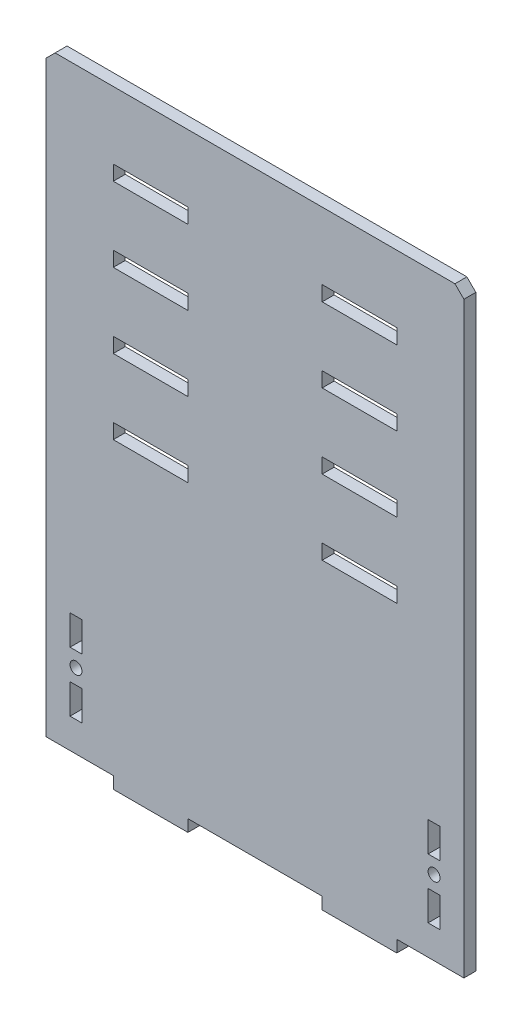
ISO-10303-21;
HEADER;
FILE_DESCRIPTION(('STEP AP214'),'2;1');
FILE_NAME('part.step','',(''),(''),'','','');
FILE_SCHEMA(('AUTOMOTIVE_DESIGN { 1 0 10303 214 1 1 1 1 }'));
ENDSEC;
DATA;
#1=APPLICATION_CONTEXT('core data for automotive mechanical design processes');
#2=APPLICATION_PROTOCOL_DEFINITION('international standard','automotive_design',2000,#1);
#3=PRODUCT_CONTEXT('',#1,'mechanical');
#4=PRODUCT('Part','Part','',(#3));
#5=PRODUCT_RELATED_PRODUCT_CATEGORY('part','',(#4));
#6=PRODUCT_DEFINITION_FORMATION('','',#4);
#7=PRODUCT_DEFINITION_CONTEXT('part definition',#1,'design');
#8=PRODUCT_DEFINITION('design','',#6,#7);
#9=PRODUCT_DEFINITION_SHAPE('','',#8);
#10=(LENGTH_UNIT() NAMED_UNIT(*) SI_UNIT(.MILLI.,.METRE.));
#11=(NAMED_UNIT(*) PLANE_ANGLE_UNIT() SI_UNIT($,.RADIAN.));
#12=(NAMED_UNIT(*) SI_UNIT($,.STERADIAN.) SOLID_ANGLE_UNIT());
#13=UNCERTAINTY_MEASURE_WITH_UNIT(LENGTH_MEASURE(1.E-05),#10,'distance_accuracy_value','');
#14=(GEOMETRIC_REPRESENTATION_CONTEXT(3) GLOBAL_UNCERTAINTY_ASSIGNED_CONTEXT((#13)) GLOBAL_UNIT_ASSIGNED_CONTEXT((#10,
#11,#12)) REPRESENTATION_CONTEXT('',''));
#15=CARTESIAN_POINT('',(0.,0.,0.));
#16=DIRECTION('',(0.,0.,1.));
#17=DIRECTION('',(1.,0.,0.));
#18=AXIS2_PLACEMENT_3D('',#15,#16,#17);
#19=CARTESIAN_POINT('',(-70.,-100.,-4.));
#20=DIRECTION('',(0.,-1.,0.));
#21=DIRECTION('',(0.,0.,-1.));
#22=AXIS2_PLACEMENT_3D('',#19,#20,#21);
#23=PLANE('',#22);
#24=DIRECTION('',(1.,0.,0.));
#25=VECTOR('',#24,1.);
#26=CARTESIAN_POINT('',(-70.,-100.,-4.));
#27=LINE('',#26,#25);
#28=CARTESIAN_POINT('',(-70.,-100.,-4.));
#29=VERTEX_POINT('',#28);
#30=CARTESIAN_POINT('',(-47.5,-100.,-4.));
#31=VERTEX_POINT('',#30);
#32=EDGE_CURVE('E783',#29,#31,#27,.T.);
#33=ORIENTED_EDGE('',*,*,#32,.T.);
#34=DIRECTION('',(0.,0.,1.));
#35=VECTOR('',#34,1.);
#36=CARTESIAN_POINT('',(-47.5,-100.,-4.));
#37=LINE('',#36,#35);
#38=CARTESIAN_POINT('',(-47.5,-100.,0.));
#39=VERTEX_POINT('',#38);
#40=EDGE_CURVE('E733',#31,#39,#37,.T.);
#41=ORIENTED_EDGE('',*,*,#40,.T.);
#42=DIRECTION('',(1.,0.,0.));
#43=VECTOR('',#42,1.);
#44=CARTESIAN_POINT('',(-70.,-100.,0.));
#45=LINE('',#44,#43);
#46=CARTESIAN_POINT('',(-70.,-100.,0.));
#47=VERTEX_POINT('',#46);
#48=EDGE_CURVE('E770',#47,#39,#45,.T.);
#49=ORIENTED_EDGE('',*,*,#48,.F.);
#50=DIRECTION('',(0.,0.,1.));
#51=VECTOR('',#50,1.);
#52=CARTESIAN_POINT('',(-70.,-100.,-4.));
#53=LINE('',#52,#51);
#54=EDGE_CURVE('E810',#29,#47,#53,.T.);
#55=ORIENTED_EDGE('',*,*,#54,.F.);
#56=EDGE_LOOP('',(#33,#41,#49,#55));
#57=FACE_BOUND('',#56,.T.);
#58=ADVANCED_FACE('F39',(#57),#23,.T.);
#59=DIRECTION('',(0.,0.,1.));
#60=VECTOR('',#59,1.);
#61=CARTESIAN_POINT('',(-22.5,-100.,-4.));
#62=LINE('',#61,#60);
#63=CARTESIAN_POINT('',(-22.5,-100.,-4.));
#64=VERTEX_POINT('',#63);
#65=CARTESIAN_POINT('',(-22.5,-100.,0.));
#66=VERTEX_POINT('',#65);
#67=EDGE_CURVE('E737',#64,#66,#62,.T.);
#68=ORIENTED_EDGE('',*,*,#67,.F.);
#69=CARTESIAN_POINT('',(22.5000000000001,-100.,-4.));
#70=VERTEX_POINT('',#69);
#71=EDGE_CURVE('E787',#64,#70,#27,.T.);
#72=ORIENTED_EDGE('',*,*,#71,.T.);
#73=DIRECTION('',(0.,0.,1.));
#74=VECTOR('',#73,1.);
#75=CARTESIAN_POINT('',(22.5000000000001,-100.,-4.));
#76=LINE('',#75,#74);
#77=CARTESIAN_POINT('',(22.5000000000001,-100.,0.));
#78=VERTEX_POINT('',#77);
#79=EDGE_CURVE('E742',#70,#78,#76,.T.);
#80=ORIENTED_EDGE('',*,*,#79,.T.);
#81=EDGE_CURVE('E805',#66,#78,#45,.T.);
#82=ORIENTED_EDGE('',*,*,#81,.F.);
#83=EDGE_LOOP('',(#68,#72,#80,#82));
#84=FACE_BOUND('',#83,.T.);
#85=ADVANCED_FACE('F958',(#84),#23,.T.);
#86=CARTESIAN_POINT('',(70.,97.,-4.));
#87=DIRECTION('',(1.,0.,0.));
#88=DIRECTION('',(0.,1.,0.));
#89=AXIS2_PLACEMENT_3D('',#86,#87,#88);
#90=PLANE('',#89);
#91=DIRECTION('',(0.,1.,0.));
#92=VECTOR('',#91,1.);
#93=CARTESIAN_POINT('',(70.,97.,0.));
#94=LINE('',#93,#92);
#95=CARTESIAN_POINT('',(70.,-100.,0.));
#96=VERTEX_POINT('',#95);
#97=CARTESIAN_POINT('',(70.,97.,0.));
#98=VERTEX_POINT('',#97);
#99=EDGE_CURVE('E736',#96,#98,#94,.T.);
#100=ORIENTED_EDGE('',*,*,#99,.F.);
#101=DIRECTION('',(0.,0.,1.));
#102=VECTOR('',#101,1.);
#103=CARTESIAN_POINT('',(70.,-100.,-4.));
#104=LINE('',#103,#102);
#105=CARTESIAN_POINT('',(70.,-100.,-4.));
#106=VERTEX_POINT('',#105);
#107=EDGE_CURVE('E806',#106,#96,#104,.T.);
#108=ORIENTED_EDGE('',*,*,#107,.F.);
#109=DIRECTION('',(0.,1.,0.));
#110=VECTOR('',#109,1.);
#111=CARTESIAN_POINT('',(70.,97.,-4.));
#112=LINE('',#111,#110);
#113=CARTESIAN_POINT('',(70.,97.,-4.));
#114=VERTEX_POINT('',#113);
#115=EDGE_CURVE('E766',#106,#114,#112,.T.);
#116=ORIENTED_EDGE('',*,*,#115,.T.);
#117=DIRECTION('',(0.,0.,1.));
#118=VECTOR('',#117,1.);
#119=CARTESIAN_POINT('',(70.,97.,-4.));
#120=LINE('',#119,#118);
#121=EDGE_CURVE('E786',#114,#98,#120,.T.);
#122=ORIENTED_EDGE('',*,*,#121,.T.);
#123=EDGE_LOOP('',(#100,#108,#116,#122));
#124=FACE_BOUND('',#123,.T.);
#125=ADVANCED_FACE('F41',(#124),#90,.T.);
#126=DIRECTION('',(0.,0.,1.));
#127=VECTOR('',#126,1.);
#128=CARTESIAN_POINT('',(47.5000000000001,-100.,-4.));
#129=LINE('',#128,#127);
#130=CARTESIAN_POINT('',(47.5000000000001,-100.,-4.));
#131=VERTEX_POINT('',#130);
#132=CARTESIAN_POINT('',(47.5000000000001,-100.,0.));
#133=VERTEX_POINT('',#132);
#134=EDGE_CURVE('E706',#131,#133,#129,.T.);
#135=ORIENTED_EDGE('',*,*,#134,.F.);
#136=EDGE_CURVE('E782',#131,#106,#27,.T.);
#137=ORIENTED_EDGE('',*,*,#136,.T.);
#138=ORIENTED_EDGE('',*,*,#107,.T.);
#139=EDGE_CURVE('E802',#133,#96,#45,.T.);
#140=ORIENTED_EDGE('',*,*,#139,.F.);
#141=EDGE_LOOP('',(#135,#137,#138,#140));
#142=FACE_BOUND('',#141,.T.);
#143=ADVANCED_FACE('F961',(#142),#23,.T.);
#144=CARTESIAN_POINT('',(-70.,97.,-4.));
#145=DIRECTION('',(-1.,0.,0.));
#146=DIRECTION('',(0.,-1.,0.));
#147=AXIS2_PLACEMENT_3D('',#144,#145,#146);
#148=PLANE('',#147);
#149=DIRECTION('',(0.,-1.,0.));
#150=VECTOR('',#149,1.);
#151=CARTESIAN_POINT('',(-70.,97.,0.));
#152=LINE('',#151,#150);
#153=CARTESIAN_POINT('',(-70.,97.,0.));
#154=VERTEX_POINT('',#153);
#155=EDGE_CURVE('E799',#154,#47,#152,.T.);
#156=ORIENTED_EDGE('',*,*,#155,.F.);
#157=DIRECTION('',(0.,0.,1.));
#158=VECTOR('',#157,1.);
#159=CARTESIAN_POINT('',(-70.,97.,-4.));
#160=LINE('',#159,#158);
#161=CARTESIAN_POINT('',(-70.,97.,-4.));
#162=VERTEX_POINT('',#161);
#163=EDGE_CURVE('E812',#162,#154,#160,.T.);
#164=ORIENTED_EDGE('',*,*,#163,.F.);
#165=DIRECTION('',(0.,-1.,0.));
#166=VECTOR('',#165,1.);
#167=CARTESIAN_POINT('',(-70.,97.,-4.));
#168=LINE('',#167,#166);
#169=EDGE_CURVE('E779',#162,#29,#168,.T.);
#170=ORIENTED_EDGE('',*,*,#169,.T.);
#171=ORIENTED_EDGE('',*,*,#54,.T.);
#172=EDGE_LOOP('',(#156,#164,#170,#171));
#173=FACE_BOUND('',#172,.T.);
#174=ADVANCED_FACE('F970',(#173),#148,.T.);
#175=CARTESIAN_POINT('',(-70.,97.,-4.));
#176=DIRECTION('',(-0.707106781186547,0.707106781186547,0.));
#177=DIRECTION('',(-0.707106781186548,-0.707106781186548,0.));
#178=AXIS2_PLACEMENT_3D('',#175,#176,#177);
#179=PLANE('',#178);
#180=DIRECTION('',(-0.707106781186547,-0.707106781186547,0.));
#181=VECTOR('',#180,1.);
#182=CARTESIAN_POINT('',(-70.,97.,0.));
#183=LINE('',#182,#181);
#184=CARTESIAN_POINT('',(-67.,100.,0.));
#185=VERTEX_POINT('',#184);
#186=EDGE_CURVE('E796',#185,#154,#183,.T.);
#187=ORIENTED_EDGE('',*,*,#186,.F.);
#188=DIRECTION('',(0.,0.,1.));
#189=VECTOR('',#188,1.);
#190=CARTESIAN_POINT('',(-67.,100.,-4.));
#191=LINE('',#190,#189);
#192=CARTESIAN_POINT('',(-67.,100.,-4.));
#193=VERTEX_POINT('',#192);
#194=EDGE_CURVE('E814',#193,#185,#191,.T.);
#195=ORIENTED_EDGE('',*,*,#194,.F.);
#196=DIRECTION('',(-0.707106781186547,-0.707106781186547,0.));
#197=VECTOR('',#196,1.);
#198=CARTESIAN_POINT('',(-70.,97.,-4.));
#199=LINE('',#198,#197);
#200=EDGE_CURVE('E776',#193,#162,#199,.T.);
#201=ORIENTED_EDGE('',*,*,#200,.T.);
#202=ORIENTED_EDGE('',*,*,#163,.T.);
#203=EDGE_LOOP('',(#187,#195,#201,#202));
#204=FACE_BOUND('',#203,.T.);
#205=ADVANCED_FACE('F976',(#204),#179,.T.);
#206=CARTESIAN_POINT('',(-67.,100.,-4.));
#207=DIRECTION('',(0.,1.,0.));
#208=DIRECTION('',(0.,0.,1.));
#209=AXIS2_PLACEMENT_3D('',#206,#207,#208);
#210=PLANE('',#209);
#211=DIRECTION('',(-1.,0.,0.));
#212=VECTOR('',#211,1.);
#213=CARTESIAN_POINT('',(-67.,100.,0.));
#214=LINE('',#213,#212);
#215=CARTESIAN_POINT('',(67.,100.,0.));
#216=VERTEX_POINT('',#215);
#217=EDGE_CURVE('E793',#216,#185,#214,.T.);
#218=ORIENTED_EDGE('',*,*,#217,.F.);
#219=DIRECTION('',(0.,0.,1.));
#220=VECTOR('',#219,1.);
#221=CARTESIAN_POINT('',(67.,100.,-4.));
#222=LINE('',#221,#220);
#223=CARTESIAN_POINT('',(67.,100.,-4.));
#224=VERTEX_POINT('',#223);
#225=EDGE_CURVE('E816',#224,#216,#222,.T.);
#226=ORIENTED_EDGE('',*,*,#225,.F.);
#227=DIRECTION('',(-1.,0.,0.));
#228=VECTOR('',#227,1.);
#229=CARTESIAN_POINT('',(-67.,100.,-4.));
#230=LINE('',#229,#228);
#231=EDGE_CURVE('E773',#224,#193,#230,.T.);
#232=ORIENTED_EDGE('',*,*,#231,.T.);
#233=ORIENTED_EDGE('',*,*,#194,.T.);
#234=EDGE_LOOP('',(#218,#226,#232,#233));
#235=FACE_BOUND('',#234,.T.);
#236=ADVANCED_FACE('F1011',(#235),#210,.T.);
#237=CARTESIAN_POINT('',(67.,100.,-4.));
#238=DIRECTION('',(0.707106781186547,0.707106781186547,0.));
#239=DIRECTION('',(-0.707106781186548,0.707106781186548,0.));
#240=AXIS2_PLACEMENT_3D('',#237,#238,#239);
#241=PLANE('',#240);
#242=DIRECTION('',(-0.707106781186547,0.707106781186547,0.));
#243=VECTOR('',#242,1.);
#244=CARTESIAN_POINT('',(67.,100.,0.));
#245=LINE('',#244,#243);
#246=EDGE_CURVE('E790',#98,#216,#245,.T.);
#247=ORIENTED_EDGE('',*,*,#246,.F.);
#248=ORIENTED_EDGE('',*,*,#121,.F.);
#249=DIRECTION('',(-0.707106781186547,0.707106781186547,0.));
#250=VECTOR('',#249,1.);
#251=CARTESIAN_POINT('',(67.,100.,-4.));
#252=LINE('',#251,#250);
#253=EDGE_CURVE('E769',#114,#224,#252,.T.);
#254=ORIENTED_EDGE('',*,*,#253,.T.);
#255=ORIENTED_EDGE('',*,*,#225,.T.);
#256=EDGE_LOOP('',(#247,#248,#254,#255));
#257=FACE_BOUND('',#256,.T.);
#258=ADVANCED_FACE('F1007',(#257),#241,.T.);
#259=CARTESIAN_POINT('',(0.,0.,-4.));
#260=DIRECTION('',(0.,0.,1.));
#261=DIRECTION('',(1.,0.,0.));
#262=AXIS2_PLACEMENT_3D('',#259,#260,#261);
#263=PLANE('',#262);
#264=CARTESIAN_POINT('',(-60.0000000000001,-75.,-4.));
#265=DIRECTION('',(0.,0.,1.));
#266=DIRECTION('',(1.,0.,0.));
#267=AXIS2_PLACEMENT_3D('',#264,#265,#266);
#268=CIRCLE('',#267,2.);
#269=CARTESIAN_POINT('',(-58.,-75.,-4.));
#270=VERTEX_POINT('',#269);
#271=EDGE_CURVE('E450',#270,#270,#268,.T.);
#272=ORIENTED_EDGE('',*,*,#271,.T.);
#273=EDGE_LOOP('',(#272));
#274=FACE_BOUND('',#273,.T.);
#275=DIRECTION('',(1.,0.,0.));
#276=VECTOR('',#275,1.);
#277=CARTESIAN_POINT('',(58.,-90.,-4.));
#278=LINE('',#277,#276);
#279=CARTESIAN_POINT('',(58.,-90.,-4.));
#280=VERTEX_POINT('',#279);
#281=CARTESIAN_POINT('',(62.,-90.,-4.));
#282=VERTEX_POINT('',#281);
#283=EDGE_CURVE('E436',#280,#282,#278,.T.);
#284=ORIENTED_EDGE('',*,*,#283,.T.);
#285=DIRECTION('',(0.,1.,0.));
#286=VECTOR('',#285,1.);
#287=CARTESIAN_POINT('',(62.,-90.,-4.));
#288=LINE('',#287,#286);
#289=CARTESIAN_POINT('',(62.,-80.,-4.));
#290=VERTEX_POINT('',#289);
#291=EDGE_CURVE('E444',#282,#290,#288,.T.);
#292=ORIENTED_EDGE('',*,*,#291,.T.);
#293=DIRECTION('',(-1.,0.,0.));
#294=VECTOR('',#293,1.);
#295=CARTESIAN_POINT('',(58.,-80.,-4.));
#296=LINE('',#295,#294);
#297=CARTESIAN_POINT('',(58.,-80.,-4.));
#298=VERTEX_POINT('',#297);
#299=EDGE_CURVE('E451',#290,#298,#296,.T.);
#300=ORIENTED_EDGE('',*,*,#299,.T.);
#301=DIRECTION('',(0.,-1.,0.));
#302=VECTOR('',#301,1.);
#303=CARTESIAN_POINT('',(58.,-90.,-4.));
#304=LINE('',#303,#302);
#305=EDGE_CURVE('E55',#298,#280,#304,.T.);
#306=ORIENTED_EDGE('',*,*,#305,.T.);
#307=EDGE_LOOP('',(#284,#292,#300,#306));
#308=FACE_BOUND('',#307,.T.);
#309=DIRECTION('',(1.,0.,0.));
#310=VECTOR('',#309,1.);
#311=CARTESIAN_POINT('',(57.9999999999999,-70.,-4.));
#312=LINE('',#311,#310);
#313=CARTESIAN_POINT('',(57.9999999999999,-70.,-4.));
#314=VERTEX_POINT('',#313);
#315=CARTESIAN_POINT('',(61.9999999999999,-70.,-4.));
#316=VERTEX_POINT('',#315);
#317=EDGE_CURVE('E464',#314,#316,#312,.T.);
#318=ORIENTED_EDGE('',*,*,#317,.T.);
#319=DIRECTION('',(0.,1.,0.));
#320=VECTOR('',#319,1.);
#321=CARTESIAN_POINT('',(61.9999999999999,-70.,-4.));
#322=LINE('',#321,#320);
#323=CARTESIAN_POINT('',(61.9999999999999,-60.,-4.));
#324=VERTEX_POINT('',#323);
#325=EDGE_CURVE('E441',#316,#324,#322,.T.);
#326=ORIENTED_EDGE('',*,*,#325,.T.);
#327=DIRECTION('',(-1.,0.,0.));
#328=VECTOR('',#327,1.);
#329=CARTESIAN_POINT('',(57.9999999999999,-60.,-4.));
#330=LINE('',#329,#328);
#331=CARTESIAN_POINT('',(57.9999999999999,-60.,-4.));
#332=VERTEX_POINT('',#331);
#333=EDGE_CURVE('E477',#324,#332,#330,.T.);
#334=ORIENTED_EDGE('',*,*,#333,.T.);
#335=DIRECTION('',(0.,-1.,0.));
#336=VECTOR('',#335,1.);
#337=CARTESIAN_POINT('',(57.9999999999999,-70.,-4.));
#338=LINE('',#337,#336);
#339=EDGE_CURVE('E63',#332,#314,#338,.T.);
#340=ORIENTED_EDGE('',*,*,#339,.T.);
#341=EDGE_LOOP('',(#318,#326,#334,#340));
#342=FACE_BOUND('',#341,.T.);
#343=DIRECTION('',(1.,0.,0.));
#344=VECTOR('',#343,1.);
#345=CARTESIAN_POINT('',(-62.0000000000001,-70.,-4.));
#346=LINE('',#345,#344);
#347=CARTESIAN_POINT('',(-62.0000000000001,-70.,-4.));
#348=VERTEX_POINT('',#347);
#349=CARTESIAN_POINT('',(-58.0000000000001,-70.,-4.));
#350=VERTEX_POINT('',#349);
#351=EDGE_CURVE('E484',#348,#350,#346,.T.);
#352=ORIENTED_EDGE('',*,*,#351,.T.);
#353=DIRECTION('',(0.,1.,0.));
#354=VECTOR('',#353,1.);
#355=CARTESIAN_POINT('',(-58.0000000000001,-70.,-4.));
#356=LINE('',#355,#354);
#357=CARTESIAN_POINT('',(-58.0000000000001,-60.,-4.));
#358=VERTEX_POINT('',#357);
#359=EDGE_CURVE('E473',#350,#358,#356,.T.);
#360=ORIENTED_EDGE('',*,*,#359,.T.);
#361=DIRECTION('',(-1.,0.,0.));
#362=VECTOR('',#361,1.);
#363=CARTESIAN_POINT('',(-62.0000000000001,-60.,-4.));
#364=LINE('',#363,#362);
#365=CARTESIAN_POINT('',(-62.0000000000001,-60.,-4.));
#366=VERTEX_POINT('',#365);
#367=EDGE_CURVE('E500',#358,#366,#364,.T.);
#368=ORIENTED_EDGE('',*,*,#367,.T.);
#369=DIRECTION('',(0.,-1.,0.));
#370=VECTOR('',#369,1.);
#371=CARTESIAN_POINT('',(-62.0000000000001,-70.,-4.));
#372=LINE('',#371,#370);
#373=EDGE_CURVE('E497',#366,#348,#372,.T.);
#374=ORIENTED_EDGE('',*,*,#373,.T.);
#375=EDGE_LOOP('',(#352,#360,#368,#374));
#376=FACE_BOUND('',#375,.T.);
#377=CARTESIAN_POINT('',(60.0000000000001,-75.,-4.));
#378=DIRECTION('',(0.,0.,1.));
#379=DIRECTION('',(-1.,0.,0.));
#380=AXIS2_PLACEMENT_3D('',#377,#378,#379);
#381=CIRCLE('',#380,2.);
#382=CARTESIAN_POINT('',(58.0000000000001,-75.,-4.));
#383=VERTEX_POINT('',#382);
#384=EDGE_CURVE('E494',#383,#383,#381,.T.);
#385=ORIENTED_EDGE('',*,*,#384,.T.);
#386=EDGE_LOOP('',(#385));
#387=FACE_BOUND('',#386,.T.);
#388=DIRECTION('',(1.,0.,0.));
#389=VECTOR('',#388,1.);
#390=CARTESIAN_POINT('',(-62.,-90.,-4.));
#391=LINE('',#390,#389);
#392=CARTESIAN_POINT('',(-62.,-90.,-4.));
#393=VERTEX_POINT('',#392);
#394=CARTESIAN_POINT('',(-58.,-90.,-4.));
#395=VERTEX_POINT('',#394);
#396=EDGE_CURVE('E514',#393,#395,#391,.T.);
#397=ORIENTED_EDGE('',*,*,#396,.T.);
#398=DIRECTION('',(0.,1.,0.));
#399=VECTOR('',#398,1.);
#400=CARTESIAN_POINT('',(-58.,-90.,-4.));
#401=LINE('',#400,#399);
#402=CARTESIAN_POINT('',(-58.,-80.,-4.));
#403=VERTEX_POINT('',#402);
#404=EDGE_CURVE('E505',#395,#403,#401,.T.);
#405=ORIENTED_EDGE('',*,*,#404,.T.);
#406=DIRECTION('',(-1.,0.,0.));
#407=VECTOR('',#406,1.);
#408=CARTESIAN_POINT('',(-62.,-80.,-4.));
#409=LINE('',#408,#407);
#410=CARTESIAN_POINT('',(-62.,-80.,-4.));
#411=VERTEX_POINT('',#410);
#412=EDGE_CURVE('E508',#403,#411,#409,.T.);
#413=ORIENTED_EDGE('',*,*,#412,.T.);
#414=DIRECTION('',(0.,-1.,0.));
#415=VECTOR('',#414,1.);
#416=CARTESIAN_POINT('',(-62.,-90.,-4.));
#417=LINE('',#416,#415);
#418=EDGE_CURVE('E511',#411,#393,#417,.T.);
#419=ORIENTED_EDGE('',*,*,#418,.T.);
#420=EDGE_LOOP('',(#397,#405,#413,#419));
#421=FACE_BOUND('',#420,.T.);
#422=DIRECTION('',(1.,0.,0.));
#423=VECTOR('',#422,1.);
#424=CARTESIAN_POINT('',(-47.5000000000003,72.5,-4.));
#425=LINE('',#424,#423);
#426=CARTESIAN_POINT('',(-47.5000000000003,72.5,-4.));
#427=VERTEX_POINT('',#426);
#428=CARTESIAN_POINT('',(-22.5000000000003,72.5,-4.));
#429=VERTEX_POINT('',#428);
#430=EDGE_CURVE('E671',#427,#429,#425,.T.);
#431=ORIENTED_EDGE('',*,*,#430,.T.);
#432=DIRECTION('',(0.,1.,0.));
#433=VECTOR('',#432,1.);
#434=CARTESIAN_POINT('',(-22.5000000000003,72.5,-4.));
#435=LINE('',#434,#433);
#436=CARTESIAN_POINT('',(-22.5000000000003,77.5,-4.));
#437=VERTEX_POINT('',#436);
#438=EDGE_CURVE('E658',#429,#437,#435,.T.);
#439=ORIENTED_EDGE('',*,*,#438,.T.);
#440=DIRECTION('',(-1.,0.,0.));
#441=VECTOR('',#440,1.);
#442=CARTESIAN_POINT('',(-47.5000000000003,77.5,-4.));
#443=LINE('',#442,#441);
#444=CARTESIAN_POINT('',(-47.5000000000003,77.5,-4.));
#445=VERTEX_POINT('',#444);
#446=EDGE_CURVE('E686',#437,#445,#443,.T.);
#447=ORIENTED_EDGE('',*,*,#446,.T.);
#448=DIRECTION('',(0.,-1.,0.));
#449=VECTOR('',#448,1.);
#450=CARTESIAN_POINT('',(-47.5000000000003,72.5,-4.));
#451=LINE('',#450,#449);
#452=EDGE_CURVE('E683',#445,#427,#451,.T.);
#453=ORIENTED_EDGE('',*,*,#452,.T.);
#454=EDGE_LOOP('',(#431,#439,#447,#453));
#455=FACE_BOUND('',#454,.T.);
#456=DIRECTION('',(1.,0.,0.));
#457=VECTOR('',#456,1.);
#458=CARTESIAN_POINT('',(-47.5000000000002,47.5,-4.));
#459=LINE('',#458,#457);
#460=CARTESIAN_POINT('',(-47.5000000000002,47.5,-4.));
#461=VERTEX_POINT('',#460);
#462=CARTESIAN_POINT('',(-22.5000000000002,47.5,-4.));
#463=VERTEX_POINT('',#462);
#464=EDGE_CURVE('E648',#461,#463,#459,.T.);
#465=ORIENTED_EDGE('',*,*,#464,.T.);
#466=DIRECTION('',(0.,1.,0.));
#467=VECTOR('',#466,1.);
#468=CARTESIAN_POINT('',(-22.5000000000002,47.5,-4.));
#469=LINE('',#468,#467);
#470=CARTESIAN_POINT('',(-22.5000000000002,52.5,-4.));
#471=VERTEX_POINT('',#470);
#472=EDGE_CURVE('E635',#463,#471,#469,.T.);
#473=ORIENTED_EDGE('',*,*,#472,.T.);
#474=DIRECTION('',(-1.,0.,0.));
#475=VECTOR('',#474,1.);
#476=CARTESIAN_POINT('',(-47.5000000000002,52.5,-4.));
#477=LINE('',#476,#475);
#478=CARTESIAN_POINT('',(-47.5000000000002,52.5,-4.));
#479=VERTEX_POINT('',#478);
#480=EDGE_CURVE('E664',#471,#479,#477,.T.);
#481=ORIENTED_EDGE('',*,*,#480,.T.);
#482=DIRECTION('',(0.,-1.,0.));
#483=VECTOR('',#482,1.);
#484=CARTESIAN_POINT('',(-47.5000000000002,47.5,-4.));
#485=LINE('',#484,#483);
#486=EDGE_CURVE('E661',#479,#461,#485,.T.);
#487=ORIENTED_EDGE('',*,*,#486,.T.);
#488=EDGE_LOOP('',(#465,#473,#481,#487));
#489=FACE_BOUND('',#488,.T.);
#490=DIRECTION('',(1.,0.,0.));
#491=VECTOR('',#490,1.);
#492=CARTESIAN_POINT('',(-47.5000000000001,22.5,-4.));
#493=LINE('',#492,#491);
#494=CARTESIAN_POINT('',(-47.5000000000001,22.5,-4.));
#495=VERTEX_POINT('',#494);
#496=CARTESIAN_POINT('',(-22.5000000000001,22.5,-4.));
#497=VERTEX_POINT('',#496);
#498=EDGE_CURVE('E625',#495,#497,#493,.T.);
#499=ORIENTED_EDGE('',*,*,#498,.T.);
#500=DIRECTION('',(0.,1.,0.));
#501=VECTOR('',#500,1.);
#502=CARTESIAN_POINT('',(-22.5000000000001,22.5,-4.));
#503=LINE('',#502,#501);
#504=CARTESIAN_POINT('',(-22.5000000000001,27.5,-4.));
#505=VERTEX_POINT('',#504);
#506=EDGE_CURVE('E612',#497,#505,#503,.T.);
#507=ORIENTED_EDGE('',*,*,#506,.T.);
#508=DIRECTION('',(-1.,0.,0.));
#509=VECTOR('',#508,1.);
#510=CARTESIAN_POINT('',(-47.5000000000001,27.5,-4.));
#511=LINE('',#510,#509);
#512=CARTESIAN_POINT('',(-47.5000000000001,27.5,-4.));
#513=VERTEX_POINT('',#512);
#514=EDGE_CURVE('E641',#505,#513,#511,.T.);
#515=ORIENTED_EDGE('',*,*,#514,.T.);
#516=DIRECTION('',(0.,-1.,0.));
#517=VECTOR('',#516,1.);
#518=CARTESIAN_POINT('',(-47.5000000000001,22.5,-4.));
#519=LINE('',#518,#517);
#520=EDGE_CURVE('E638',#513,#495,#519,.T.);
#521=ORIENTED_EDGE('',*,*,#520,.T.);
#522=EDGE_LOOP('',(#499,#507,#515,#521));
#523=FACE_BOUND('',#522,.T.);
#524=DIRECTION('',(1.,0.,0.));
#525=VECTOR('',#524,1.);
#526=CARTESIAN_POINT('',(22.4999999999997,72.5,-4.));
#527=LINE('',#526,#525);
#528=CARTESIAN_POINT('',(22.4999999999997,72.5,-4.));
#529=VERTEX_POINT('',#528);
#530=CARTESIAN_POINT('',(47.4999999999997,72.5,-4.));
#531=VERTEX_POINT('',#530);
#532=EDGE_CURVE('E602',#529,#531,#527,.T.);
#533=ORIENTED_EDGE('',*,*,#532,.T.);
#534=DIRECTION('',(0.,1.,0.));
#535=VECTOR('',#534,1.);
#536=CARTESIAN_POINT('',(47.4999999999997,72.5,-4.));
#537=LINE('',#536,#535);
#538=CARTESIAN_POINT('',(47.4999999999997,77.5,-4.));
#539=VERTEX_POINT('',#538);
#540=EDGE_CURVE('E589',#531,#539,#537,.T.);
#541=ORIENTED_EDGE('',*,*,#540,.T.);
#542=DIRECTION('',(-1.,0.,0.));
#543=VECTOR('',#542,1.);
#544=CARTESIAN_POINT('',(22.4999999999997,77.5,-4.));
#545=LINE('',#544,#543);
#546=CARTESIAN_POINT('',(22.4999999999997,77.5,-4.));
#547=VERTEX_POINT('',#546);
#548=EDGE_CURVE('E618',#539,#547,#545,.T.);
#549=ORIENTED_EDGE('',*,*,#548,.T.);
#550=DIRECTION('',(0.,-1.,0.));
#551=VECTOR('',#550,1.);
#552=CARTESIAN_POINT('',(22.4999999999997,72.5,-4.));
#553=LINE('',#552,#551);
#554=EDGE_CURVE('E615',#547,#529,#553,.T.);
#555=ORIENTED_EDGE('',*,*,#554,.T.);
#556=EDGE_LOOP('',(#533,#541,#549,#555));
#557=FACE_BOUND('',#556,.T.);
#558=DIRECTION('',(1.,0.,0.));
#559=VECTOR('',#558,1.);
#560=CARTESIAN_POINT('',(22.4999999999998,47.5,-4.));
#561=LINE('',#560,#559);
#562=CARTESIAN_POINT('',(22.4999999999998,47.5,-4.));
#563=VERTEX_POINT('',#562);
#564=CARTESIAN_POINT('',(47.4999999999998,47.5,-4.));
#565=VERTEX_POINT('',#564);
#566=EDGE_CURVE('E579',#563,#565,#561,.T.);
#567=ORIENTED_EDGE('',*,*,#566,.T.);
#568=DIRECTION('',(0.,1.,0.));
#569=VECTOR('',#568,1.);
#570=CARTESIAN_POINT('',(47.4999999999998,47.5,-4.));
#571=LINE('',#570,#569);
#572=CARTESIAN_POINT('',(47.4999999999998,52.5,-4.));
#573=VERTEX_POINT('',#572);
#574=EDGE_CURVE('E566',#565,#573,#571,.T.);
#575=ORIENTED_EDGE('',*,*,#574,.T.);
#576=DIRECTION('',(-1.,0.,0.));
#577=VECTOR('',#576,1.);
#578=CARTESIAN_POINT('',(22.4999999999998,52.5,-4.));
#579=LINE('',#578,#577);
#580=CARTESIAN_POINT('',(22.4999999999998,52.5,-4.));
#581=VERTEX_POINT('',#580);
#582=EDGE_CURVE('E595',#573,#581,#579,.T.);
#583=ORIENTED_EDGE('',*,*,#582,.T.);
#584=DIRECTION('',(0.,-1.,0.));
#585=VECTOR('',#584,1.);
#586=CARTESIAN_POINT('',(22.4999999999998,47.5,-4.));
#587=LINE('',#586,#585);
#588=EDGE_CURVE('E592',#581,#563,#587,.T.);
#589=ORIENTED_EDGE('',*,*,#588,.T.);
#590=EDGE_LOOP('',(#567,#575,#583,#589));
#591=FACE_BOUND('',#590,.T.);
#592=DIRECTION('',(1.,0.,0.));
#593=VECTOR('',#592,1.);
#594=CARTESIAN_POINT('',(22.4999999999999,22.5,-4.));
#595=LINE('',#594,#593);
#596=CARTESIAN_POINT('',(22.4999999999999,22.5,-4.));
#597=VERTEX_POINT('',#596);
#598=CARTESIAN_POINT('',(47.4999999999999,22.5,-4.));
#599=VERTEX_POINT('',#598);
#600=EDGE_CURVE('E556',#597,#599,#595,.T.);
#601=ORIENTED_EDGE('',*,*,#600,.T.);
#602=DIRECTION('',(0.,1.,0.));
#603=VECTOR('',#602,1.);
#604=CARTESIAN_POINT('',(47.4999999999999,22.5,-4.));
#605=LINE('',#604,#603);
#606=CARTESIAN_POINT('',(47.4999999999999,27.5,-4.));
#607=VERTEX_POINT('',#606);
#608=EDGE_CURVE('E541',#599,#607,#605,.T.);
#609=ORIENTED_EDGE('',*,*,#608,.T.);
#610=DIRECTION('',(-1.,0.,0.));
#611=VECTOR('',#610,1.);
#612=CARTESIAN_POINT('',(22.4999999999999,27.5,-4.));
#613=LINE('',#612,#611);
#614=CARTESIAN_POINT('',(22.4999999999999,27.5,-4.));
#615=VERTEX_POINT('',#614);
#616=EDGE_CURVE('E572',#607,#615,#613,.T.);
#617=ORIENTED_EDGE('',*,*,#616,.T.);
#618=DIRECTION('',(0.,-1.,0.));
#619=VECTOR('',#618,1.);
#620=CARTESIAN_POINT('',(22.4999999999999,22.5,-4.));
#621=LINE('',#620,#619);
#622=EDGE_CURVE('E569',#615,#597,#621,.T.);
#623=ORIENTED_EDGE('',*,*,#622,.T.);
#624=EDGE_LOOP('',(#601,#609,#617,#623));
#625=FACE_BOUND('',#624,.T.);
#626=DIRECTION('',(1.,0.,0.));
#627=VECTOR('',#626,1.);
#628=CARTESIAN_POINT('',(22.5,-2.50000000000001,-4.));
#629=LINE('',#628,#627);
#630=CARTESIAN_POINT('',(22.5,-2.50000000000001,-4.));
#631=VERTEX_POINT('',#630);
#632=CARTESIAN_POINT('',(47.5,-2.50000000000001,-4.));
#633=VERTEX_POINT('',#632);
#634=EDGE_CURVE('E531',#631,#633,#629,.T.);
#635=ORIENTED_EDGE('',*,*,#634,.T.);
#636=DIRECTION('',(0.,1.,0.));
#637=VECTOR('',#636,1.);
#638=CARTESIAN_POINT('',(47.5,-2.50000000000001,-4.));
#639=LINE('',#638,#637);
#640=CARTESIAN_POINT('',(47.5,2.49999999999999,-4.));
#641=VERTEX_POINT('',#640);
#642=EDGE_CURVE('E550',#633,#641,#639,.T.);
#643=ORIENTED_EDGE('',*,*,#642,.T.);
#644=DIRECTION('',(-1.,0.,0.));
#645=VECTOR('',#644,1.);
#646=CARTESIAN_POINT('',(22.5,2.49999999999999,-4.));
#647=LINE('',#646,#645);
#648=CARTESIAN_POINT('',(22.5,2.49999999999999,-4.));
#649=VERTEX_POINT('',#648);
#650=EDGE_CURVE('E547',#641,#649,#647,.T.);
#651=ORIENTED_EDGE('',*,*,#650,.T.);
#652=DIRECTION('',(0.,-1.,0.));
#653=VECTOR('',#652,1.);
#654=CARTESIAN_POINT('',(22.5,-2.50000000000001,-4.));
#655=LINE('',#654,#653);
#656=EDGE_CURVE('E544',#649,#631,#655,.T.);
#657=ORIENTED_EDGE('',*,*,#656,.T.);
#658=EDGE_LOOP('',(#635,#643,#651,#657));
#659=FACE_BOUND('',#658,.T.);
#660=DIRECTION('',(1.,0.,0.));
#661=VECTOR('',#660,1.);
#662=CARTESIAN_POINT('',(-47.5,-2.50000000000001,-4.));
#663=LINE('',#662,#661);
#664=CARTESIAN_POINT('',(-47.5,-2.50000000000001,-4.));
#665=VERTEX_POINT('',#664);
#666=CARTESIAN_POINT('',(-22.5,-2.50000000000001,-4.));
#667=VERTEX_POINT('',#666);
#668=EDGE_CURVE('E699',#665,#667,#663,.T.);
#669=ORIENTED_EDGE('',*,*,#668,.T.);
#670=DIRECTION('',(0.,1.,0.));
#671=VECTOR('',#670,1.);
#672=CARTESIAN_POINT('',(-22.5,-2.50000000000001,-4.));
#673=LINE('',#672,#671);
#674=CARTESIAN_POINT('',(-22.5,2.49999999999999,-4.));
#675=VERTEX_POINT('',#674);
#676=EDGE_CURVE('E553',#667,#675,#673,.T.);
#677=ORIENTED_EDGE('',*,*,#676,.T.);
#678=DIRECTION('',(-1.,0.,0.));
#679=VECTOR('',#678,1.);
#680=CARTESIAN_POINT('',(-47.5,2.49999999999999,-4.));
#681=LINE('',#680,#679);
#682=CARTESIAN_POINT('',(-47.5,2.49999999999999,-4.));
#683=VERTEX_POINT('',#682);
#684=EDGE_CURVE('E693',#675,#683,#681,.T.);
#685=ORIENTED_EDGE('',*,*,#684,.T.);
#686=DIRECTION('',(0.,-1.,0.));
#687=VECTOR('',#686,1.);
#688=CARTESIAN_POINT('',(-47.5,-2.50000000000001,-4.));
#689=LINE('',#688,#687);
#690=EDGE_CURVE('E696',#683,#665,#689,.T.);
#691=ORIENTED_EDGE('',*,*,#690,.T.);
#692=EDGE_LOOP('',(#669,#677,#685,#691));
#693=FACE_BOUND('',#692,.T.);
#694=ORIENTED_EDGE('',*,*,#115,.F.);
#695=ORIENTED_EDGE('',*,*,#136,.F.);
#696=DIRECTION('',(0.,1.,0.));
#697=VECTOR('',#696,1.);
#698=CARTESIAN_POINT('',(47.5000000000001,-100.,-4.));
#699=LINE('',#698,#697);
#700=CARTESIAN_POINT('',(47.5000000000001,-104.,-4.));
#701=VERTEX_POINT('',#700);
#702=EDGE_CURVE('E745',#701,#131,#699,.T.);
#703=ORIENTED_EDGE('',*,*,#702,.F.);
#704=DIRECTION('',(1.,0.,0.));
#705=VECTOR('',#704,1.);
#706=CARTESIAN_POINT('',(47.5000000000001,-104.,-4.));
#707=LINE('',#706,#705);
#708=CARTESIAN_POINT('',(22.5000000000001,-104.,-4.));
#709=VERTEX_POINT('',#708);
#710=EDGE_CURVE('E761',#709,#701,#707,.T.);
#711=ORIENTED_EDGE('',*,*,#710,.F.);
#712=DIRECTION('',(0.,-1.,0.));
#713=VECTOR('',#712,1.);
#714=CARTESIAN_POINT('',(22.5000000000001,-100.,-4.));
#715=LINE('',#714,#713);
#716=EDGE_CURVE('E755',#70,#709,#715,.T.);
#717=ORIENTED_EDGE('',*,*,#716,.F.);
#718=ORIENTED_EDGE('',*,*,#71,.F.);
#719=DIRECTION('',(0.,1.,0.));
#720=VECTOR('',#719,1.);
#721=CARTESIAN_POINT('',(-22.5,-100.,-4.));
#722=LINE('',#721,#720);
#723=CARTESIAN_POINT('',(-22.5,-104.,-4.));
#724=VERTEX_POINT('',#723);
#725=EDGE_CURVE('E721',#724,#64,#722,.T.);
#726=ORIENTED_EDGE('',*,*,#725,.F.);
#727=DIRECTION('',(1.,0.,0.));
#728=VECTOR('',#727,1.);
#729=CARTESIAN_POINT('',(-47.5,-104.,-4.));
#730=LINE('',#729,#728);
#731=CARTESIAN_POINT('',(-47.5,-104.,-4.));
#732=VERTEX_POINT('',#731);
#733=EDGE_CURVE('E717',#732,#724,#730,.T.);
#734=ORIENTED_EDGE('',*,*,#733,.F.);
#735=DIRECTION('',(0.,-1.,0.));
#736=VECTOR('',#735,1.);
#737=CARTESIAN_POINT('',(-47.5,-100.,-4.));
#738=LINE('',#737,#736);
#739=EDGE_CURVE('E714',#31,#732,#738,.T.);
#740=ORIENTED_EDGE('',*,*,#739,.F.);
#741=ORIENTED_EDGE('',*,*,#32,.F.);
#742=ORIENTED_EDGE('',*,*,#169,.F.);
#743=ORIENTED_EDGE('',*,*,#200,.F.);
#744=ORIENTED_EDGE('',*,*,#231,.F.);
#745=ORIENTED_EDGE('',*,*,#253,.F.);
#746=EDGE_LOOP('',(#694,#695,#703,#711,#717,#718,#726,#734,#740,#741,#742,#743,#744,#745));
#747=FACE_BOUND('',#746,.T.);
#748=ADVANCED_FACE('F453',(#274,#308,#342,#376,#387,#421,#455,#489,#523,#557,#591,#625,#659,
#693,#747),#263,.F.);
#749=CARTESIAN_POINT('',(0.,0.,0.));
#750=DIRECTION('',(0.,0.,1.));
#751=DIRECTION('',(1.,0.,0.));
#752=AXIS2_PLACEMENT_3D('',#749,#750,#751);
#753=PLANE('',#752);
#754=CARTESIAN_POINT('',(-60.0000000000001,-75.,0.));
#755=DIRECTION('',(0.,0.,1.));
#756=DIRECTION('',(1.,0.,0.));
#757=AXIS2_PLACEMENT_3D('',#754,#755,#756);
#758=CIRCLE('',#757,2.);
#759=CARTESIAN_POINT('',(-58.,-75.,0.));
#760=VERTEX_POINT('',#759);
#761=EDGE_CURVE('E43',#760,#760,#758,.T.);
#762=ORIENTED_EDGE('',*,*,#761,.F.);
#763=EDGE_LOOP('',(#762));
#764=FACE_BOUND('',#763,.T.);
#765=DIRECTION('',(0.,1.,0.));
#766=VECTOR('',#765,1.);
#767=CARTESIAN_POINT('',(62.,0.,0.));
#768=LINE('',#767,#766);
#769=CARTESIAN_POINT('',(62.,-90.,0.));
#770=VERTEX_POINT('',#769);
#771=CARTESIAN_POINT('',(62.,-80.,0.));
#772=VERTEX_POINT('',#771);
#773=EDGE_CURVE('E11',#770,#772,#768,.T.);
#774=ORIENTED_EDGE('',*,*,#773,.F.);
#775=DIRECTION('',(1.,0.,0.));
#776=VECTOR('',#775,1.);
#777=CARTESIAN_POINT('',(0.,-90.,0.));
#778=LINE('',#777,#776);
#779=CARTESIAN_POINT('',(58.,-90.,0.));
#780=VERTEX_POINT('',#779);
#781=EDGE_CURVE('E48',#780,#770,#778,.T.);
#782=ORIENTED_EDGE('',*,*,#781,.F.);
#783=DIRECTION('',(0.,-1.,0.));
#784=VECTOR('',#783,1.);
#785=CARTESIAN_POINT('',(58.,0.,0.));
#786=LINE('',#785,#784);
#787=CARTESIAN_POINT('',(58.,-80.,0.));
#788=VERTEX_POINT('',#787);
#789=EDGE_CURVE('E921',#788,#780,#786,.T.);
#790=ORIENTED_EDGE('',*,*,#789,.F.);
#791=DIRECTION('',(-1.,0.,0.));
#792=VECTOR('',#791,1.);
#793=CARTESIAN_POINT('',(0.,-80.,0.));
#794=LINE('',#793,#792);
#795=EDGE_CURVE('E919',#772,#788,#794,.T.);
#796=ORIENTED_EDGE('',*,*,#795,.F.);
#797=EDGE_LOOP('',(#774,#782,#790,#796));
#798=FACE_BOUND('',#797,.T.);
#799=DIRECTION('',(0.,1.,0.));
#800=VECTOR('',#799,1.);
#801=CARTESIAN_POINT('',(61.9999999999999,0.,0.));
#802=LINE('',#801,#800);
#803=CARTESIAN_POINT('',(61.9999999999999,-70.,0.));
#804=VERTEX_POINT('',#803);
#805=CARTESIAN_POINT('',(61.9999999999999,-60.,0.));
#806=VERTEX_POINT('',#805);
#807=EDGE_CURVE('E916',#804,#806,#802,.T.);
#808=ORIENTED_EDGE('',*,*,#807,.F.);
#809=DIRECTION('',(1.,0.,0.));
#810=VECTOR('',#809,1.);
#811=CARTESIAN_POINT('',(0.,-70.,0.));
#812=LINE('',#811,#810);
#813=CARTESIAN_POINT('',(57.9999999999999,-70.,0.));
#814=VERTEX_POINT('',#813);
#815=EDGE_CURVE('E914',#814,#804,#812,.T.);
#816=ORIENTED_EDGE('',*,*,#815,.F.);
#817=DIRECTION('',(0.,-1.,0.));
#818=VECTOR('',#817,1.);
#819=CARTESIAN_POINT('',(57.9999999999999,0.,0.));
#820=LINE('',#819,#818);
#821=CARTESIAN_POINT('',(57.9999999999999,-60.,0.));
#822=VERTEX_POINT('',#821);
#823=EDGE_CURVE('E912',#822,#814,#820,.T.);
#824=ORIENTED_EDGE('',*,*,#823,.F.);
#825=DIRECTION('',(-1.,0.,0.));
#826=VECTOR('',#825,1.);
#827=CARTESIAN_POINT('',(0.,-60.,0.));
#828=LINE('',#827,#826);
#829=EDGE_CURVE('E910',#806,#822,#828,.T.);
#830=ORIENTED_EDGE('',*,*,#829,.F.);
#831=EDGE_LOOP('',(#808,#816,#824,#830));
#832=FACE_BOUND('',#831,.T.);
#833=DIRECTION('',(0.,1.,0.));
#834=VECTOR('',#833,1.);
#835=CARTESIAN_POINT('',(-58.0000000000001,0.,0.));
#836=LINE('',#835,#834);
#837=CARTESIAN_POINT('',(-58.0000000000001,-70.,0.));
#838=VERTEX_POINT('',#837);
#839=CARTESIAN_POINT('',(-58.0000000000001,-60.,0.));
#840=VERTEX_POINT('',#839);
#841=EDGE_CURVE('E907',#838,#840,#836,.T.);
#842=ORIENTED_EDGE('',*,*,#841,.F.);
#843=DIRECTION('',(1.,0.,0.));
#844=VECTOR('',#843,1.);
#845=CARTESIAN_POINT('',(0.,-70.,0.));
#846=LINE('',#845,#844);
#847=CARTESIAN_POINT('',(-62.0000000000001,-70.,0.));
#848=VERTEX_POINT('',#847);
#849=EDGE_CURVE('E905',#848,#838,#846,.T.);
#850=ORIENTED_EDGE('',*,*,#849,.F.);
#851=DIRECTION('',(0.,-1.,0.));
#852=VECTOR('',#851,1.);
#853=CARTESIAN_POINT('',(-62.0000000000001,0.,0.));
#854=LINE('',#853,#852);
#855=CARTESIAN_POINT('',(-62.0000000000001,-60.,0.));
#856=VERTEX_POINT('',#855);
#857=EDGE_CURVE('E903',#856,#848,#854,.T.);
#858=ORIENTED_EDGE('',*,*,#857,.F.);
#859=DIRECTION('',(-1.,0.,0.));
#860=VECTOR('',#859,1.);
#861=CARTESIAN_POINT('',(0.,-60.,0.));
#862=LINE('',#861,#860);
#863=EDGE_CURVE('E899',#840,#856,#862,.T.);
#864=ORIENTED_EDGE('',*,*,#863,.F.);
#865=EDGE_LOOP('',(#842,#850,#858,#864));
#866=FACE_BOUND('',#865,.T.);
#867=CARTESIAN_POINT('',(60.0000000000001,-75.,0.));
#868=DIRECTION('',(0.,0.,1.));
#869=DIRECTION('',(1.,0.,0.));
#870=AXIS2_PLACEMENT_3D('',#867,#868,#869);
#871=CIRCLE('',#870,2.);
#872=CARTESIAN_POINT('',(62.0000000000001,-75.,0.));
#873=VERTEX_POINT('',#872);
#874=EDGE_CURVE('E521',#873,#873,#871,.T.);
#875=ORIENTED_EDGE('',*,*,#874,.F.);
#876=EDGE_LOOP('',(#875));
#877=FACE_BOUND('',#876,.T.);
#878=DIRECTION('',(0.,1.,0.));
#879=VECTOR('',#878,1.);
#880=CARTESIAN_POINT('',(-58.,0.,0.));
#881=LINE('',#880,#879);
#882=CARTESIAN_POINT('',(-58.,-90.,0.));
#883=VERTEX_POINT('',#882);
#884=CARTESIAN_POINT('',(-58.,-80.,0.));
#885=VERTEX_POINT('',#884);
#886=EDGE_CURVE('E896',#883,#885,#881,.T.);
#887=ORIENTED_EDGE('',*,*,#886,.F.);
#888=DIRECTION('',(1.,0.,0.));
#889=VECTOR('',#888,1.);
#890=CARTESIAN_POINT('',(0.,-90.,0.));
#891=LINE('',#890,#889);
#892=CARTESIAN_POINT('',(-62.,-90.,0.));
#893=VERTEX_POINT('',#892);
#894=EDGE_CURVE('E894',#893,#883,#891,.T.);
#895=ORIENTED_EDGE('',*,*,#894,.F.);
#896=DIRECTION('',(0.,-1.,0.));
#897=VECTOR('',#896,1.);
#898=CARTESIAN_POINT('',(-62.,0.,0.));
#899=LINE('',#898,#897);
#900=CARTESIAN_POINT('',(-62.,-80.,0.));
#901=VERTEX_POINT('',#900);
#902=EDGE_CURVE('E892',#901,#893,#899,.T.);
#903=ORIENTED_EDGE('',*,*,#902,.F.);
#904=DIRECTION('',(-1.,0.,0.));
#905=VECTOR('',#904,1.);
#906=CARTESIAN_POINT('',(0.,-80.,0.));
#907=LINE('',#906,#905);
#908=EDGE_CURVE('E890',#885,#901,#907,.T.);
#909=ORIENTED_EDGE('',*,*,#908,.F.);
#910=EDGE_LOOP('',(#887,#895,#903,#909));
#911=FACE_BOUND('',#910,.T.);
#912=DIRECTION('',(0.,1.,0.));
#913=VECTOR('',#912,1.);
#914=CARTESIAN_POINT('',(-22.5000000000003,0.,0.));
#915=LINE('',#914,#913);
#916=CARTESIAN_POINT('',(-22.5000000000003,72.5,0.));
#917=VERTEX_POINT('',#916);
#918=CARTESIAN_POINT('',(-22.5000000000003,77.5,0.));
#919=VERTEX_POINT('',#918);
#920=EDGE_CURVE('E887',#917,#919,#915,.T.);
#921=ORIENTED_EDGE('',*,*,#920,.F.);
#922=DIRECTION('',(1.,0.,0.));
#923=VECTOR('',#922,1.);
#924=CARTESIAN_POINT('',(0.,72.5,0.));
#925=LINE('',#924,#923);
#926=CARTESIAN_POINT('',(-47.5000000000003,72.5,0.));
#927=VERTEX_POINT('',#926);
#928=EDGE_CURVE('E885',#927,#917,#925,.T.);
#929=ORIENTED_EDGE('',*,*,#928,.F.);
#930=DIRECTION('',(0.,-1.,0.));
#931=VECTOR('',#930,1.);
#932=CARTESIAN_POINT('',(-47.5000000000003,0.,0.));
#933=LINE('',#932,#931);
#934=CARTESIAN_POINT('',(-47.5000000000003,77.5,0.));
#935=VERTEX_POINT('',#934);
#936=EDGE_CURVE('E883',#935,#927,#933,.T.);
#937=ORIENTED_EDGE('',*,*,#936,.F.);
#938=DIRECTION('',(-1.,0.,0.));
#939=VECTOR('',#938,1.);
#940=CARTESIAN_POINT('',(0.,77.5,0.));
#941=LINE('',#940,#939);
#942=EDGE_CURVE('E881',#919,#935,#941,.T.);
#943=ORIENTED_EDGE('',*,*,#942,.F.);
#944=EDGE_LOOP('',(#921,#929,#937,#943));
#945=FACE_BOUND('',#944,.T.);
#946=DIRECTION('',(0.,1.,0.));
#947=VECTOR('',#946,1.);
#948=CARTESIAN_POINT('',(-22.5000000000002,0.,0.));
#949=LINE('',#948,#947);
#950=CARTESIAN_POINT('',(-22.5000000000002,47.5,0.));
#951=VERTEX_POINT('',#950);
#952=CARTESIAN_POINT('',(-22.5000000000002,52.5,0.));
#953=VERTEX_POINT('',#952);
#954=EDGE_CURVE('E878',#951,#953,#949,.T.);
#955=ORIENTED_EDGE('',*,*,#954,.F.);
#956=DIRECTION('',(1.,0.,0.));
#957=VECTOR('',#956,1.);
#958=CARTESIAN_POINT('',(0.,47.5,0.));
#959=LINE('',#958,#957);
#960=CARTESIAN_POINT('',(-47.5000000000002,47.5,0.));
#961=VERTEX_POINT('',#960);
#962=EDGE_CURVE('E876',#961,#951,#959,.T.);
#963=ORIENTED_EDGE('',*,*,#962,.F.);
#964=DIRECTION('',(0.,-1.,0.));
#965=VECTOR('',#964,1.);
#966=CARTESIAN_POINT('',(-47.5000000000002,0.,0.));
#967=LINE('',#966,#965);
#968=CARTESIAN_POINT('',(-47.5000000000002,52.5,0.));
#969=VERTEX_POINT('',#968);
#970=EDGE_CURVE('E874',#969,#961,#967,.T.);
#971=ORIENTED_EDGE('',*,*,#970,.F.);
#972=DIRECTION('',(-1.,0.,0.));
#973=VECTOR('',#972,1.);
#974=CARTESIAN_POINT('',(0.,52.5,0.));
#975=LINE('',#974,#973);
#976=EDGE_CURVE('E872',#953,#969,#975,.T.);
#977=ORIENTED_EDGE('',*,*,#976,.F.);
#978=EDGE_LOOP('',(#955,#963,#971,#977));
#979=FACE_BOUND('',#978,.T.);
#980=DIRECTION('',(0.,1.,0.));
#981=VECTOR('',#980,1.);
#982=CARTESIAN_POINT('',(-22.5000000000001,0.,0.));
#983=LINE('',#982,#981);
#984=CARTESIAN_POINT('',(-22.5000000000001,22.5,0.));
#985=VERTEX_POINT('',#984);
#986=CARTESIAN_POINT('',(-22.5000000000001,27.5,0.));
#987=VERTEX_POINT('',#986);
#988=EDGE_CURVE('E869',#985,#987,#983,.T.);
#989=ORIENTED_EDGE('',*,*,#988,.F.);
#990=DIRECTION('',(1.,0.,0.));
#991=VECTOR('',#990,1.);
#992=CARTESIAN_POINT('',(0.,22.5,0.));
#993=LINE('',#992,#991);
#994=CARTESIAN_POINT('',(-47.5000000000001,22.5,0.));
#995=VERTEX_POINT('',#994);
#996=EDGE_CURVE('E867',#995,#985,#993,.T.);
#997=ORIENTED_EDGE('',*,*,#996,.F.);
#998=DIRECTION('',(0.,-1.,0.));
#999=VECTOR('',#998,1.);
#1000=CARTESIAN_POINT('',(-47.5000000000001,0.,0.));
#1001=LINE('',#1000,#999);
#1002=CARTESIAN_POINT('',(-47.5000000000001,27.5,0.));
#1003=VERTEX_POINT('',#1002);
#1004=EDGE_CURVE('E865',#1003,#995,#1001,.T.);
#1005=ORIENTED_EDGE('',*,*,#1004,.F.);
#1006=DIRECTION('',(-1.,0.,0.));
#1007=VECTOR('',#1006,1.);
#1008=CARTESIAN_POINT('',(0.,27.5,0.));
#1009=LINE('',#1008,#1007);
#1010=EDGE_CURVE('E863',#987,#1003,#1009,.T.);
#1011=ORIENTED_EDGE('',*,*,#1010,.F.);
#1012=EDGE_LOOP('',(#989,#997,#1005,#1011));
#1013=FACE_BOUND('',#1012,.T.);
#1014=DIRECTION('',(0.,1.,0.));
#1015=VECTOR('',#1014,1.);
#1016=CARTESIAN_POINT('',(47.4999999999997,0.,0.));
#1017=LINE('',#1016,#1015);
#1018=CARTESIAN_POINT('',(47.4999999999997,72.5,0.));
#1019=VERTEX_POINT('',#1018);
#1020=CARTESIAN_POINT('',(47.4999999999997,77.5,0.));
#1021=VERTEX_POINT('',#1020);
#1022=EDGE_CURVE('E860',#1019,#1021,#1017,.T.);
#1023=ORIENTED_EDGE('',*,*,#1022,.F.);
#1024=DIRECTION('',(1.,0.,0.));
#1025=VECTOR('',#1024,1.);
#1026=CARTESIAN_POINT('',(0.,72.5,0.));
#1027=LINE('',#1026,#1025);
#1028=CARTESIAN_POINT('',(22.4999999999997,72.5,0.));
#1029=VERTEX_POINT('',#1028);
#1030=EDGE_CURVE('E858',#1029,#1019,#1027,.T.);
#1031=ORIENTED_EDGE('',*,*,#1030,.F.);
#1032=DIRECTION('',(0.,-1.,0.));
#1033=VECTOR('',#1032,1.);
#1034=CARTESIAN_POINT('',(22.4999999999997,0.,0.));
#1035=LINE('',#1034,#1033);
#1036=CARTESIAN_POINT('',(22.4999999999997,77.5,0.));
#1037=VERTEX_POINT('',#1036);
#1038=EDGE_CURVE('E856',#1037,#1029,#1035,.T.);
#1039=ORIENTED_EDGE('',*,*,#1038,.F.);
#1040=DIRECTION('',(-1.,0.,0.));
#1041=VECTOR('',#1040,1.);
#1042=CARTESIAN_POINT('',(0.,77.5,0.));
#1043=LINE('',#1042,#1041);
#1044=EDGE_CURVE('E854',#1021,#1037,#1043,.T.);
#1045=ORIENTED_EDGE('',*,*,#1044,.F.);
#1046=EDGE_LOOP('',(#1023,#1031,#1039,#1045));
#1047=FACE_BOUND('',#1046,.T.);
#1048=DIRECTION('',(0.,1.,0.));
#1049=VECTOR('',#1048,1.);
#1050=CARTESIAN_POINT('',(47.4999999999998,0.,0.));
#1051=LINE('',#1050,#1049);
#1052=CARTESIAN_POINT('',(47.4999999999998,47.5,0.));
#1053=VERTEX_POINT('',#1052);
#1054=CARTESIAN_POINT('',(47.4999999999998,52.5,0.));
#1055=VERTEX_POINT('',#1054);
#1056=EDGE_CURVE('E851',#1053,#1055,#1051,.T.);
#1057=ORIENTED_EDGE('',*,*,#1056,.F.);
#1058=DIRECTION('',(1.,0.,0.));
#1059=VECTOR('',#1058,1.);
#1060=CARTESIAN_POINT('',(0.,47.5,0.));
#1061=LINE('',#1060,#1059);
#1062=CARTESIAN_POINT('',(22.4999999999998,47.5,0.));
#1063=VERTEX_POINT('',#1062);
#1064=EDGE_CURVE('E849',#1063,#1053,#1061,.T.);
#1065=ORIENTED_EDGE('',*,*,#1064,.F.);
#1066=DIRECTION('',(0.,-1.,0.));
#1067=VECTOR('',#1066,1.);
#1068=CARTESIAN_POINT('',(22.4999999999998,0.,0.));
#1069=LINE('',#1068,#1067);
#1070=CARTESIAN_POINT('',(22.4999999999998,52.5,0.));
#1071=VERTEX_POINT('',#1070);
#1072=EDGE_CURVE('E847',#1071,#1063,#1069,.T.);
#1073=ORIENTED_EDGE('',*,*,#1072,.F.);
#1074=DIRECTION('',(-1.,0.,0.));
#1075=VECTOR('',#1074,1.);
#1076=CARTESIAN_POINT('',(0.,52.5,0.));
#1077=LINE('',#1076,#1075);
#1078=EDGE_CURVE('E845',#1055,#1071,#1077,.T.);
#1079=ORIENTED_EDGE('',*,*,#1078,.F.);
#1080=EDGE_LOOP('',(#1057,#1065,#1073,#1079));
#1081=FACE_BOUND('',#1080,.T.);
#1082=DIRECTION('',(0.,1.,0.));
#1083=VECTOR('',#1082,1.);
#1084=CARTESIAN_POINT('',(47.4999999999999,0.,0.));
#1085=LINE('',#1084,#1083);
#1086=CARTESIAN_POINT('',(47.4999999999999,22.5,0.));
#1087=VERTEX_POINT('',#1086);
#1088=CARTESIAN_POINT('',(47.4999999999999,27.5,0.));
#1089=VERTEX_POINT('',#1088);
#1090=EDGE_CURVE('E842',#1087,#1089,#1085,.T.);
#1091=ORIENTED_EDGE('',*,*,#1090,.F.);
#1092=DIRECTION('',(1.,0.,0.));
#1093=VECTOR('',#1092,1.);
#1094=CARTESIAN_POINT('',(0.,22.5,0.));
#1095=LINE('',#1094,#1093);
#1096=CARTESIAN_POINT('',(22.4999999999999,22.5,0.));
#1097=VERTEX_POINT('',#1096);
#1098=EDGE_CURVE('E840',#1097,#1087,#1095,.T.);
#1099=ORIENTED_EDGE('',*,*,#1098,.F.);
#1100=DIRECTION('',(0.,-1.,0.));
#1101=VECTOR('',#1100,1.);
#1102=CARTESIAN_POINT('',(22.4999999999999,0.,0.));
#1103=LINE('',#1102,#1101);
#1104=CARTESIAN_POINT('',(22.4999999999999,27.5,0.));
#1105=VERTEX_POINT('',#1104);
#1106=EDGE_CURVE('E838',#1105,#1097,#1103,.T.);
#1107=ORIENTED_EDGE('',*,*,#1106,.F.);
#1108=DIRECTION('',(-1.,0.,0.));
#1109=VECTOR('',#1108,1.);
#1110=CARTESIAN_POINT('',(0.,27.5,0.));
#1111=LINE('',#1110,#1109);
#1112=EDGE_CURVE('E836',#1089,#1105,#1111,.T.);
#1113=ORIENTED_EDGE('',*,*,#1112,.F.);
#1114=EDGE_LOOP('',(#1091,#1099,#1107,#1113));
#1115=FACE_BOUND('',#1114,.T.);
#1116=DIRECTION('',(0.,1.,0.));
#1117=VECTOR('',#1116,1.);
#1118=CARTESIAN_POINT('',(47.5,0.,0.));
#1119=LINE('',#1118,#1117);
#1120=CARTESIAN_POINT('',(47.5,-2.50000000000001,0.));
#1121=VERTEX_POINT('',#1120);
#1122=CARTESIAN_POINT('',(47.5,2.49999999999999,0.));
#1123=VERTEX_POINT('',#1122);
#1124=EDGE_CURVE('E833',#1121,#1123,#1119,.T.);
#1125=ORIENTED_EDGE('',*,*,#1124,.F.);
#1126=DIRECTION('',(1.,0.,0.));
#1127=VECTOR('',#1126,1.);
#1128=CARTESIAN_POINT('',(0.,-2.50000000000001,0.));
#1129=LINE('',#1128,#1127);
#1130=CARTESIAN_POINT('',(22.5,-2.50000000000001,0.));
#1131=VERTEX_POINT('',#1130);
#1132=EDGE_CURVE('E831',#1131,#1121,#1129,.T.);
#1133=ORIENTED_EDGE('',*,*,#1132,.F.);
#1134=DIRECTION('',(0.,-1.,0.));
#1135=VECTOR('',#1134,1.);
#1136=CARTESIAN_POINT('',(22.5,0.,0.));
#1137=LINE('',#1136,#1135);
#1138=CARTESIAN_POINT('',(22.5,2.49999999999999,0.));
#1139=VERTEX_POINT('',#1138);
#1140=EDGE_CURVE('E829',#1139,#1131,#1137,.T.);
#1141=ORIENTED_EDGE('',*,*,#1140,.F.);
#1142=DIRECTION('',(-1.,0.,0.));
#1143=VECTOR('',#1142,1.);
#1144=CARTESIAN_POINT('',(0.,2.49999999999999,0.));
#1145=LINE('',#1144,#1143);
#1146=EDGE_CURVE('E827',#1123,#1139,#1145,.T.);
#1147=ORIENTED_EDGE('',*,*,#1146,.F.);
#1148=EDGE_LOOP('',(#1125,#1133,#1141,#1147));
#1149=FACE_BOUND('',#1148,.T.);
#1150=DIRECTION('',(0.,1.,0.));
#1151=VECTOR('',#1150,1.);
#1152=CARTESIAN_POINT('',(-22.5,0.,0.));
#1153=LINE('',#1152,#1151);
#1154=CARTESIAN_POINT('',(-22.5,-2.50000000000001,0.));
#1155=VERTEX_POINT('',#1154);
#1156=CARTESIAN_POINT('',(-22.5,2.49999999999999,0.));
#1157=VERTEX_POINT('',#1156);
#1158=EDGE_CURVE('E824',#1155,#1157,#1153,.T.);
#1159=ORIENTED_EDGE('',*,*,#1158,.F.);
#1160=DIRECTION('',(1.,0.,0.));
#1161=VECTOR('',#1160,1.);
#1162=CARTESIAN_POINT('',(0.,-2.50000000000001,0.));
#1163=LINE('',#1162,#1161);
#1164=CARTESIAN_POINT('',(-47.5,-2.50000000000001,0.));
#1165=VERTEX_POINT('',#1164);
#1166=EDGE_CURVE('E822',#1165,#1155,#1163,.T.);
#1167=ORIENTED_EDGE('',*,*,#1166,.F.);
#1168=DIRECTION('',(0.,-1.,0.));
#1169=VECTOR('',#1168,1.);
#1170=CARTESIAN_POINT('',(-47.5,0.,0.));
#1171=LINE('',#1170,#1169);
#1172=CARTESIAN_POINT('',(-47.5,2.49999999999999,0.));
#1173=VERTEX_POINT('',#1172);
#1174=EDGE_CURVE('E820',#1173,#1165,#1171,.T.);
#1175=ORIENTED_EDGE('',*,*,#1174,.F.);
#1176=DIRECTION('',(-1.,0.,0.));
#1177=VECTOR('',#1176,1.);
#1178=CARTESIAN_POINT('',(0.,2.49999999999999,0.));
#1179=LINE('',#1178,#1177);
#1180=EDGE_CURVE('E809',#1157,#1173,#1179,.T.);
#1181=ORIENTED_EDGE('',*,*,#1180,.F.);
#1182=EDGE_LOOP('',(#1159,#1167,#1175,#1181));
#1183=FACE_BOUND('',#1182,.T.);
#1184=ORIENTED_EDGE('',*,*,#99,.T.);
#1185=ORIENTED_EDGE('',*,*,#246,.T.);
#1186=ORIENTED_EDGE('',*,*,#217,.T.);
#1187=ORIENTED_EDGE('',*,*,#186,.T.);
#1188=ORIENTED_EDGE('',*,*,#155,.T.);
#1189=ORIENTED_EDGE('',*,*,#48,.T.);
#1190=DIRECTION('',(0.,-1.,0.));
#1191=VECTOR('',#1190,1.);
#1192=CARTESIAN_POINT('',(-47.5,-100.,0.));
#1193=LINE('',#1192,#1191);
#1194=CARTESIAN_POINT('',(-47.5,-104.,0.));
#1195=VERTEX_POINT('',#1194);
#1196=EDGE_CURVE('E724',#39,#1195,#1193,.T.);
#1197=ORIENTED_EDGE('',*,*,#1196,.T.);
#1198=DIRECTION('',(1.,0.,0.));
#1199=VECTOR('',#1198,1.);
#1200=CARTESIAN_POINT('',(-47.5,-104.,0.));
#1201=LINE('',#1200,#1199);
#1202=CARTESIAN_POINT('',(-22.5,-104.,0.));
#1203=VERTEX_POINT('',#1202);
#1204=EDGE_CURVE('E727',#1195,#1203,#1201,.T.);
#1205=ORIENTED_EDGE('',*,*,#1204,.T.);
#1206=DIRECTION('',(0.,1.,0.));
#1207=VECTOR('',#1206,1.);
#1208=CARTESIAN_POINT('',(-22.5,-100.,0.));
#1209=LINE('',#1208,#1207);
#1210=EDGE_CURVE('E718',#1203,#66,#1209,.T.);
#1211=ORIENTED_EDGE('',*,*,#1210,.T.);
#1212=ORIENTED_EDGE('',*,*,#81,.T.);
#1213=DIRECTION('',(0.,-1.,0.));
#1214=VECTOR('',#1213,1.);
#1215=CARTESIAN_POINT('',(22.5000000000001,-100.,0.));
#1216=LINE('',#1215,#1214);
#1217=CARTESIAN_POINT('',(22.5000000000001,-104.,0.));
#1218=VERTEX_POINT('',#1217);
#1219=EDGE_CURVE('E728',#78,#1218,#1216,.T.);
#1220=ORIENTED_EDGE('',*,*,#1219,.T.);
#1221=DIRECTION('',(1.,0.,0.));
#1222=VECTOR('',#1221,1.);
#1223=CARTESIAN_POINT('',(47.5000000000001,-104.,0.));
#1224=LINE('',#1223,#1222);
#1225=CARTESIAN_POINT('',(47.5000000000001,-104.,0.));
#1226=VERTEX_POINT('',#1225);
#1227=EDGE_CURVE('E754',#1218,#1226,#1224,.T.);
#1228=ORIENTED_EDGE('',*,*,#1227,.T.);
#1229=DIRECTION('',(0.,1.,0.));
#1230=VECTOR('',#1229,1.);
#1231=CARTESIAN_POINT('',(47.5000000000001,-100.,0.));
#1232=LINE('',#1231,#1230);
#1233=EDGE_CURVE('E751',#1226,#133,#1232,.T.);
#1234=ORIENTED_EDGE('',*,*,#1233,.T.);
#1235=ORIENTED_EDGE('',*,*,#139,.T.);
#1236=EDGE_LOOP('',(#1184,#1185,#1186,#1187,#1188,#1189,#1197,#1205,#1211,#1212,#1220,#1228,
#1234,#1235));
#1237=FACE_BOUND('',#1236,.T.);
#1238=ADVANCED_FACE('F927',(#764,#798,#832,#866,#877,#911,#945,#979,#1013,#1047,#1081,#1115,
#1149,#1183,#1237),#753,.T.);
#1239=CARTESIAN_POINT('',(47.5000000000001,-100.,-4.));
#1240=DIRECTION('',(1.,0.,0.));
#1241=DIRECTION('',(0.,0.,-1.));
#1242=AXIS2_PLACEMENT_3D('',#1239,#1240,#1241);
#1243=PLANE('',#1242);
#1244=ORIENTED_EDGE('',*,*,#1233,.F.);
#1245=DIRECTION('',(0.,0.,1.));
#1246=VECTOR('',#1245,1.);
#1247=CARTESIAN_POINT('',(47.5000000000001,-104.,-4.));
#1248=LINE('',#1247,#1246);
#1249=EDGE_CURVE('E748',#701,#1226,#1248,.T.);
#1250=ORIENTED_EDGE('',*,*,#1249,.F.);
#1251=ORIENTED_EDGE('',*,*,#702,.T.);
#1252=ORIENTED_EDGE('',*,*,#134,.T.);
#1253=EDGE_LOOP('',(#1244,#1250,#1251,#1252));
#1254=FACE_BOUND('',#1253,.T.);
#1255=ADVANCED_FACE('F1044',(#1254),#1243,.T.);
#1256=CARTESIAN_POINT('',(47.5000000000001,-104.,-4.));
#1257=DIRECTION('',(0.,-1.,0.));
#1258=DIRECTION('',(0.,0.,-1.));
#1259=AXIS2_PLACEMENT_3D('',#1256,#1257,#1258);
#1260=PLANE('',#1259);
#1261=ORIENTED_EDGE('',*,*,#1227,.F.);
#1262=DIRECTION('',(0.,0.,1.));
#1263=VECTOR('',#1262,1.);
#1264=CARTESIAN_POINT('',(22.5000000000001,-104.,-4.));
#1265=LINE('',#1264,#1263);
#1266=EDGE_CURVE('E746',#709,#1218,#1265,.T.);
#1267=ORIENTED_EDGE('',*,*,#1266,.F.);
#1268=ORIENTED_EDGE('',*,*,#710,.T.);
#1269=ORIENTED_EDGE('',*,*,#1249,.T.);
#1270=EDGE_LOOP('',(#1261,#1267,#1268,#1269));
#1271=FACE_BOUND('',#1270,.T.);
#1272=ADVANCED_FACE('F1041',(#1271),#1260,.T.);
#1273=CARTESIAN_POINT('',(22.5000000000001,-100.,-4.));
#1274=DIRECTION('',(-1.,0.,0.));
#1275=DIRECTION('',(0.,-1.,0.));
#1276=AXIS2_PLACEMENT_3D('',#1273,#1274,#1275);
#1277=PLANE('',#1276);
#1278=ORIENTED_EDGE('',*,*,#1219,.F.);
#1279=ORIENTED_EDGE('',*,*,#79,.F.);
#1280=ORIENTED_EDGE('',*,*,#716,.T.);
#1281=ORIENTED_EDGE('',*,*,#1266,.T.);
#1282=EDGE_LOOP('',(#1278,#1279,#1280,#1281));
#1283=FACE_BOUND('',#1282,.T.);
#1284=ADVANCED_FACE('F1000',(#1283),#1277,.T.);
#1285=CARTESIAN_POINT('',(-47.5,-100.,-4.));
#1286=DIRECTION('',(-1.,0.,0.));
#1287=DIRECTION('',(0.,0.,1.));
#1288=AXIS2_PLACEMENT_3D('',#1285,#1286,#1287);
#1289=PLANE('',#1288);
#1290=ORIENTED_EDGE('',*,*,#1196,.F.);
#1291=ORIENTED_EDGE('',*,*,#40,.F.);
#1292=ORIENTED_EDGE('',*,*,#739,.T.);
#1293=DIRECTION('',(0.,0.,1.));
#1294=VECTOR('',#1293,1.);
#1295=CARTESIAN_POINT('',(-47.5,-104.,-4.));
#1296=LINE('',#1295,#1294);
#1297=EDGE_CURVE('E723',#732,#1195,#1296,.T.);
#1298=ORIENTED_EDGE('',*,*,#1297,.T.);
#1299=EDGE_LOOP('',(#1290,#1291,#1292,#1298));
#1300=FACE_BOUND('',#1299,.T.);
#1301=ADVANCED_FACE('F1021',(#1300),#1289,.T.);
#1302=CARTESIAN_POINT('',(-22.5,-100.,-4.));
#1303=DIRECTION('',(1.,0.,0.));
#1304=DIRECTION('',(0.,1.,0.));
#1305=AXIS2_PLACEMENT_3D('',#1302,#1303,#1304);
#1306=PLANE('',#1305);
#1307=ORIENTED_EDGE('',*,*,#1210,.F.);
#1308=DIRECTION('',(0.,0.,1.));
#1309=VECTOR('',#1308,1.);
#1310=CARTESIAN_POINT('',(-22.5,-104.,-4.));
#1311=LINE('',#1310,#1309);
#1312=EDGE_CURVE('E739',#724,#1203,#1311,.T.);
#1313=ORIENTED_EDGE('',*,*,#1312,.F.);
#1314=ORIENTED_EDGE('',*,*,#725,.T.);
#1315=ORIENTED_EDGE('',*,*,#67,.T.);
#1316=EDGE_LOOP('',(#1307,#1313,#1314,#1315));
#1317=FACE_BOUND('',#1316,.T.);
#1318=ADVANCED_FACE('F1026',(#1317),#1306,.T.);
#1319=CARTESIAN_POINT('',(-47.5,-104.,-4.));
#1320=DIRECTION('',(0.,-1.,0.));
#1321=DIRECTION('',(1.,0.,0.));
#1322=AXIS2_PLACEMENT_3D('',#1319,#1320,#1321);
#1323=PLANE('',#1322);
#1324=ORIENTED_EDGE('',*,*,#1204,.F.);
#1325=ORIENTED_EDGE('',*,*,#1297,.F.);
#1326=ORIENTED_EDGE('',*,*,#733,.T.);
#1327=ORIENTED_EDGE('',*,*,#1312,.T.);
#1328=EDGE_LOOP('',(#1324,#1325,#1326,#1327));
#1329=FACE_BOUND('',#1328,.T.);
#1330=ADVANCED_FACE('F1024',(#1329),#1323,.T.);
#1331=CARTESIAN_POINT('',(-22.5,-2.50000000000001,-4.));
#1332=DIRECTION('',(1.,0.,0.));
#1333=DIRECTION('',(0.,0.,-1.));
#1334=AXIS2_PLACEMENT_3D('',#1331,#1332,#1333);
#1335=PLANE('',#1334);
#1336=ORIENTED_EDGE('',*,*,#1158,.T.);
#1337=DIRECTION('',(0.,0.,1.));
#1338=VECTOR('',#1337,1.);
#1339=CARTESIAN_POINT('',(-22.5,2.49999999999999,-4.));
#1340=LINE('',#1339,#1338);
#1341=EDGE_CURVE('E702',#675,#1157,#1340,.T.);
#1342=ORIENTED_EDGE('',*,*,#1341,.F.);
#1343=ORIENTED_EDGE('',*,*,#676,.F.);
#1344=DIRECTION('',(0.,0.,1.));
#1345=VECTOR('',#1344,1.);
#1346=CARTESIAN_POINT('',(-22.5,-2.50000000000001,-4.));
#1347=LINE('',#1346,#1345);
#1348=EDGE_CURVE('E703',#667,#1155,#1347,.T.);
#1349=ORIENTED_EDGE('',*,*,#1348,.T.);
#1350=EDGE_LOOP('',(#1336,#1342,#1343,#1349));
#1351=FACE_BOUND('',#1350,.T.);
#1352=ADVANCED_FACE('F1033',(#1351),#1335,.F.);
#1353=CARTESIAN_POINT('',(-47.5,-2.50000000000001,-4.));
#1354=DIRECTION('',(0.,-1.,0.));
#1355=DIRECTION('',(0.,0.,-1.));
#1356=AXIS2_PLACEMENT_3D('',#1353,#1354,#1355);
#1357=PLANE('',#1356);
#1358=ORIENTED_EDGE('',*,*,#1166,.T.);
#1359=ORIENTED_EDGE('',*,*,#1348,.F.);
#1360=ORIENTED_EDGE('',*,*,#668,.F.);
#1361=DIRECTION('',(0.,0.,1.));
#1362=VECTOR('',#1361,1.);
#1363=CARTESIAN_POINT('',(-47.5,-2.50000000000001,-4.));
#1364=LINE('',#1363,#1362);
#1365=EDGE_CURVE('E707',#665,#1165,#1364,.T.);
#1366=ORIENTED_EDGE('',*,*,#1365,.T.);
#1367=EDGE_LOOP('',(#1358,#1359,#1360,#1366));
#1368=FACE_BOUND('',#1367,.T.);
#1369=ADVANCED_FACE('F1221',(#1368),#1357,.F.);
#1370=CARTESIAN_POINT('',(-47.5,-2.50000000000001,-4.));
#1371=DIRECTION('',(-1.,0.,0.));
#1372=DIRECTION('',(0.,0.,1.));
#1373=AXIS2_PLACEMENT_3D('',#1370,#1371,#1372);
#1374=PLANE('',#1373);
#1375=ORIENTED_EDGE('',*,*,#1174,.T.);
#1376=ORIENTED_EDGE('',*,*,#1365,.F.);
#1377=ORIENTED_EDGE('',*,*,#690,.F.);
#1378=DIRECTION('',(0.,0.,1.));
#1379=VECTOR('',#1378,1.);
#1380=CARTESIAN_POINT('',(-47.5,2.49999999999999,-4.));
#1381=LINE('',#1380,#1379);
#1382=EDGE_CURVE('E710',#683,#1173,#1381,.T.);
#1383=ORIENTED_EDGE('',*,*,#1382,.T.);
#1384=EDGE_LOOP('',(#1375,#1376,#1377,#1383));
#1385=FACE_BOUND('',#1384,.T.);
#1386=ADVANCED_FACE('F1224',(#1385),#1374,.F.);
#1387=CARTESIAN_POINT('',(-47.5,2.49999999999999,-4.));
#1388=DIRECTION('',(0.,1.,0.));
#1389=DIRECTION('',(0.,0.,1.));
#1390=AXIS2_PLACEMENT_3D('',#1387,#1388,#1389);
#1391=PLANE('',#1390);
#1392=ORIENTED_EDGE('',*,*,#1180,.T.);
#1393=ORIENTED_EDGE('',*,*,#1382,.F.);
#1394=ORIENTED_EDGE('',*,*,#684,.F.);
#1395=ORIENTED_EDGE('',*,*,#1341,.T.);
#1396=EDGE_LOOP('',(#1392,#1393,#1394,#1395));
#1397=FACE_BOUND('',#1396,.T.);
#1398=ADVANCED_FACE('F1113',(#1397),#1391,.F.);
#1399=CARTESIAN_POINT('',(47.5,-2.50000000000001,-4.));
#1400=DIRECTION('',(1.,0.,0.));
#1401=DIRECTION('',(0.,0.,-1.));
#1402=AXIS2_PLACEMENT_3D('',#1399,#1400,#1401);
#1403=PLANE('',#1402);
#1404=ORIENTED_EDGE('',*,*,#1124,.T.);
#1405=DIRECTION('',(0.,0.,1.));
#1406=VECTOR('',#1405,1.);
#1407=CARTESIAN_POINT('',(47.5,2.49999999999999,-4.));
#1408=LINE('',#1407,#1406);
#1409=EDGE_CURVE('E529',#641,#1123,#1408,.T.);
#1410=ORIENTED_EDGE('',*,*,#1409,.F.);
#1411=ORIENTED_EDGE('',*,*,#642,.F.);
#1412=DIRECTION('',(0.,0.,1.));
#1413=VECTOR('',#1412,1.);
#1414=CARTESIAN_POINT('',(47.5,-2.50000000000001,-4.));
#1415=LINE('',#1414,#1413);
#1416=EDGE_CURVE('E538',#633,#1121,#1415,.T.);
#1417=ORIENTED_EDGE('',*,*,#1416,.T.);
#1418=EDGE_LOOP('',(#1404,#1410,#1411,#1417));
#1419=FACE_BOUND('',#1418,.T.);
#1420=ADVANCED_FACE('F1109',(#1419),#1403,.F.);
#1421=CARTESIAN_POINT('',(22.5,-2.50000000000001,-4.));
#1422=DIRECTION('',(0.,-1.,0.));
#1423=DIRECTION('',(0.,0.,-1.));
#1424=AXIS2_PLACEMENT_3D('',#1421,#1422,#1423);
#1425=PLANE('',#1424);
#1426=ORIENTED_EDGE('',*,*,#1132,.T.);
#1427=ORIENTED_EDGE('',*,*,#1416,.F.);
#1428=ORIENTED_EDGE('',*,*,#634,.F.);
#1429=DIRECTION('',(0.,0.,1.));
#1430=VECTOR('',#1429,1.);
#1431=CARTESIAN_POINT('',(22.5,-2.50000000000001,-4.));
#1432=LINE('',#1431,#1430);
#1433=EDGE_CURVE('E535',#631,#1131,#1432,.T.);
#1434=ORIENTED_EDGE('',*,*,#1433,.T.);
#1435=EDGE_LOOP('',(#1426,#1427,#1428,#1434));
#1436=FACE_BOUND('',#1435,.T.);
#1437=ADVANCED_FACE('F1112',(#1436),#1425,.F.);
#1438=CARTESIAN_POINT('',(22.5,-2.50000000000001,-4.));
#1439=DIRECTION('',(-1.,0.,0.));
#1440=DIRECTION('',(0.,0.,1.));
#1441=AXIS2_PLACEMENT_3D('',#1438,#1439,#1440);
#1442=PLANE('',#1441);
#1443=ORIENTED_EDGE('',*,*,#1140,.T.);
#1444=ORIENTED_EDGE('',*,*,#1433,.F.);
#1445=ORIENTED_EDGE('',*,*,#656,.F.);
#1446=DIRECTION('',(0.,0.,1.));
#1447=VECTOR('',#1446,1.);
#1448=CARTESIAN_POINT('',(22.5,2.49999999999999,-4.));
#1449=LINE('',#1448,#1447);
#1450=EDGE_CURVE('E532',#649,#1139,#1449,.T.);
#1451=ORIENTED_EDGE('',*,*,#1450,.T.);
#1452=EDGE_LOOP('',(#1443,#1444,#1445,#1451));
#1453=FACE_BOUND('',#1452,.T.);
#1454=ADVANCED_FACE('F1119',(#1453),#1442,.F.);
#1455=CARTESIAN_POINT('',(22.5,2.49999999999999,-4.));
#1456=DIRECTION('',(0.,1.,0.));
#1457=DIRECTION('',(0.,0.,1.));
#1458=AXIS2_PLACEMENT_3D('',#1455,#1456,#1457);
#1459=PLANE('',#1458);
#1460=ORIENTED_EDGE('',*,*,#1146,.T.);
#1461=ORIENTED_EDGE('',*,*,#1450,.F.);
#1462=ORIENTED_EDGE('',*,*,#650,.F.);
#1463=ORIENTED_EDGE('',*,*,#1409,.T.);
#1464=EDGE_LOOP('',(#1460,#1461,#1462,#1463));
#1465=FACE_BOUND('',#1464,.T.);
#1466=ADVANCED_FACE('F1115',(#1465),#1459,.F.);
#1467=CARTESIAN_POINT('',(47.4999999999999,22.5,-4.));
#1468=DIRECTION('',(1.,0.,0.));
#1469=DIRECTION('',(0.,0.,-1.));
#1470=AXIS2_PLACEMENT_3D('',#1467,#1468,#1469);
#1471=PLANE('',#1470);
#1472=ORIENTED_EDGE('',*,*,#1090,.T.);
#1473=DIRECTION('',(0.,0.,1.));
#1474=VECTOR('',#1473,1.);
#1475=CARTESIAN_POINT('',(47.4999999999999,27.5,-4.));
#1476=LINE('',#1475,#1474);
#1477=EDGE_CURVE('E554',#607,#1089,#1476,.T.);
#1478=ORIENTED_EDGE('',*,*,#1477,.F.);
#1479=ORIENTED_EDGE('',*,*,#608,.F.);
#1480=DIRECTION('',(0.,0.,1.));
#1481=VECTOR('',#1480,1.);
#1482=CARTESIAN_POINT('',(47.4999999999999,22.5,-4.));
#1483=LINE('',#1482,#1481);
#1484=EDGE_CURVE('E563',#599,#1087,#1483,.T.);
#1485=ORIENTED_EDGE('',*,*,#1484,.T.);
#1486=EDGE_LOOP('',(#1472,#1478,#1479,#1485));
#1487=FACE_BOUND('',#1486,.T.);
#1488=ADVANCED_FACE('F1118',(#1487),#1471,.F.);
#1489=CARTESIAN_POINT('',(22.4999999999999,22.5,-4.));
#1490=DIRECTION('',(0.,-1.,0.));
#1491=DIRECTION('',(0.,0.,-1.));
#1492=AXIS2_PLACEMENT_3D('',#1489,#1490,#1491);
#1493=PLANE('',#1492);
#1494=ORIENTED_EDGE('',*,*,#1098,.T.);
#1495=ORIENTED_EDGE('',*,*,#1484,.F.);
#1496=ORIENTED_EDGE('',*,*,#600,.F.);
#1497=DIRECTION('',(0.,0.,1.));
#1498=VECTOR('',#1497,1.);
#1499=CARTESIAN_POINT('',(22.4999999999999,22.5,-4.));
#1500=LINE('',#1499,#1498);
#1501=EDGE_CURVE('E560',#597,#1097,#1500,.T.);
#1502=ORIENTED_EDGE('',*,*,#1501,.T.);
#1503=EDGE_LOOP('',(#1494,#1495,#1496,#1502));
#1504=FACE_BOUND('',#1503,.T.);
#1505=ADVANCED_FACE('F1129',(#1504),#1493,.F.);
#1506=CARTESIAN_POINT('',(22.4999999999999,22.5,-4.));
#1507=DIRECTION('',(-1.,0.,0.));
#1508=DIRECTION('',(0.,0.,1.));
#1509=AXIS2_PLACEMENT_3D('',#1506,#1507,#1508);
#1510=PLANE('',#1509);
#1511=ORIENTED_EDGE('',*,*,#1106,.T.);
#1512=ORIENTED_EDGE('',*,*,#1501,.F.);
#1513=ORIENTED_EDGE('',*,*,#622,.F.);
#1514=DIRECTION('',(0.,0.,1.));
#1515=VECTOR('',#1514,1.);
#1516=CARTESIAN_POINT('',(22.4999999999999,27.5,-4.));
#1517=LINE('',#1516,#1515);
#1518=EDGE_CURVE('E557',#615,#1105,#1517,.T.);
#1519=ORIENTED_EDGE('',*,*,#1518,.T.);
#1520=EDGE_LOOP('',(#1511,#1512,#1513,#1519));
#1521=FACE_BOUND('',#1520,.T.);
#1522=ADVANCED_FACE('F1135',(#1521),#1510,.F.);
#1523=CARTESIAN_POINT('',(22.4999999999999,27.5,-4.));
#1524=DIRECTION('',(0.,1.,0.));
#1525=DIRECTION('',(0.,0.,1.));
#1526=AXIS2_PLACEMENT_3D('',#1523,#1524,#1525);
#1527=PLANE('',#1526);
#1528=ORIENTED_EDGE('',*,*,#1112,.T.);
#1529=ORIENTED_EDGE('',*,*,#1518,.F.);
#1530=ORIENTED_EDGE('',*,*,#616,.F.);
#1531=ORIENTED_EDGE('',*,*,#1477,.T.);
#1532=EDGE_LOOP('',(#1528,#1529,#1530,#1531));
#1533=FACE_BOUND('',#1532,.T.);
#1534=ADVANCED_FACE('F1131',(#1533),#1527,.F.);
#1535=CARTESIAN_POINT('',(47.4999999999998,47.5,-4.));
#1536=DIRECTION('',(1.,0.,0.));
#1537=DIRECTION('',(0.,0.,-1.));
#1538=AXIS2_PLACEMENT_3D('',#1535,#1536,#1537);
#1539=PLANE('',#1538);
#1540=ORIENTED_EDGE('',*,*,#1056,.T.);
#1541=DIRECTION('',(0.,0.,1.));
#1542=VECTOR('',#1541,1.);
#1543=CARTESIAN_POINT('',(47.4999999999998,52.5,-4.));
#1544=LINE('',#1543,#1542);
#1545=EDGE_CURVE('E577',#573,#1055,#1544,.T.);
#1546=ORIENTED_EDGE('',*,*,#1545,.F.);
#1547=ORIENTED_EDGE('',*,*,#574,.F.);
#1548=DIRECTION('',(0.,0.,1.));
#1549=VECTOR('',#1548,1.);
#1550=CARTESIAN_POINT('',(47.4999999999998,47.5,-4.));
#1551=LINE('',#1550,#1549);
#1552=EDGE_CURVE('E586',#565,#1053,#1551,.T.);
#1553=ORIENTED_EDGE('',*,*,#1552,.T.);
#1554=EDGE_LOOP('',(#1540,#1546,#1547,#1553));
#1555=FACE_BOUND('',#1554,.T.);
#1556=ADVANCED_FACE('F1134',(#1555),#1539,.F.);
#1557=CARTESIAN_POINT('',(22.4999999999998,47.5,-4.));
#1558=DIRECTION('',(0.,-1.,0.));
#1559=DIRECTION('',(0.,0.,-1.));
#1560=AXIS2_PLACEMENT_3D('',#1557,#1558,#1559);
#1561=PLANE('',#1560);
#1562=ORIENTED_EDGE('',*,*,#1064,.T.);
#1563=ORIENTED_EDGE('',*,*,#1552,.F.);
#1564=ORIENTED_EDGE('',*,*,#566,.F.);
#1565=DIRECTION('',(0.,0.,1.));
#1566=VECTOR('',#1565,1.);
#1567=CARTESIAN_POINT('',(22.4999999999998,47.5,-4.));
#1568=LINE('',#1567,#1566);
#1569=EDGE_CURVE('E583',#563,#1063,#1568,.T.);
#1570=ORIENTED_EDGE('',*,*,#1569,.T.);
#1571=EDGE_LOOP('',(#1562,#1563,#1564,#1570));
#1572=FACE_BOUND('',#1571,.T.);
#1573=ADVANCED_FACE('F1145',(#1572),#1561,.F.);
#1574=CARTESIAN_POINT('',(22.4999999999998,47.5,-4.));
#1575=DIRECTION('',(-1.,0.,0.));
#1576=DIRECTION('',(0.,0.,1.));
#1577=AXIS2_PLACEMENT_3D('',#1574,#1575,#1576);
#1578=PLANE('',#1577);
#1579=ORIENTED_EDGE('',*,*,#1072,.T.);
#1580=ORIENTED_EDGE('',*,*,#1569,.F.);
#1581=ORIENTED_EDGE('',*,*,#588,.F.);
#1582=DIRECTION('',(0.,0.,1.));
#1583=VECTOR('',#1582,1.);
#1584=CARTESIAN_POINT('',(22.4999999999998,52.5,-4.));
#1585=LINE('',#1584,#1583);
#1586=EDGE_CURVE('E580',#581,#1071,#1585,.T.);
#1587=ORIENTED_EDGE('',*,*,#1586,.T.);
#1588=EDGE_LOOP('',(#1579,#1580,#1581,#1587));
#1589=FACE_BOUND('',#1588,.T.);
#1590=ADVANCED_FACE('F1151',(#1589),#1578,.F.);
#1591=CARTESIAN_POINT('',(22.4999999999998,52.5,-4.));
#1592=DIRECTION('',(0.,1.,0.));
#1593=DIRECTION('',(0.,0.,1.));
#1594=AXIS2_PLACEMENT_3D('',#1591,#1592,#1593);
#1595=PLANE('',#1594);
#1596=ORIENTED_EDGE('',*,*,#1078,.T.);
#1597=ORIENTED_EDGE('',*,*,#1586,.F.);
#1598=ORIENTED_EDGE('',*,*,#582,.F.);
#1599=ORIENTED_EDGE('',*,*,#1545,.T.);
#1600=EDGE_LOOP('',(#1596,#1597,#1598,#1599));
#1601=FACE_BOUND('',#1600,.T.);
#1602=ADVANCED_FACE('F1147',(#1601),#1595,.F.);
#1603=CARTESIAN_POINT('',(47.4999999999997,72.5,-4.));
#1604=DIRECTION('',(1.,0.,0.));
#1605=DIRECTION('',(0.,0.,-1.));
#1606=AXIS2_PLACEMENT_3D('',#1603,#1604,#1605);
#1607=PLANE('',#1606);
#1608=ORIENTED_EDGE('',*,*,#1022,.T.);
#1609=DIRECTION('',(0.,0.,1.));
#1610=VECTOR('',#1609,1.);
#1611=CARTESIAN_POINT('',(47.4999999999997,77.5,-4.));
#1612=LINE('',#1611,#1610);
#1613=EDGE_CURVE('E600',#539,#1021,#1612,.T.);
#1614=ORIENTED_EDGE('',*,*,#1613,.F.);
#1615=ORIENTED_EDGE('',*,*,#540,.F.);
#1616=DIRECTION('',(0.,0.,1.));
#1617=VECTOR('',#1616,1.);
#1618=CARTESIAN_POINT('',(47.4999999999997,72.5,-4.));
#1619=LINE('',#1618,#1617);
#1620=EDGE_CURVE('E609',#531,#1019,#1619,.T.);
#1621=ORIENTED_EDGE('',*,*,#1620,.T.);
#1622=EDGE_LOOP('',(#1608,#1614,#1615,#1621));
#1623=FACE_BOUND('',#1622,.T.);
#1624=ADVANCED_FACE('F1150',(#1623),#1607,.F.);
#1625=CARTESIAN_POINT('',(22.4999999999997,72.5,-4.));
#1626=DIRECTION('',(0.,-1.,0.));
#1627=DIRECTION('',(0.,0.,-1.));
#1628=AXIS2_PLACEMENT_3D('',#1625,#1626,#1627);
#1629=PLANE('',#1628);
#1630=ORIENTED_EDGE('',*,*,#1030,.T.);
#1631=ORIENTED_EDGE('',*,*,#1620,.F.);
#1632=ORIENTED_EDGE('',*,*,#532,.F.);
#1633=DIRECTION('',(0.,0.,1.));
#1634=VECTOR('',#1633,1.);
#1635=CARTESIAN_POINT('',(22.4999999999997,72.5,-4.));
#1636=LINE('',#1635,#1634);
#1637=EDGE_CURVE('E606',#529,#1029,#1636,.T.);
#1638=ORIENTED_EDGE('',*,*,#1637,.T.);
#1639=EDGE_LOOP('',(#1630,#1631,#1632,#1638));
#1640=FACE_BOUND('',#1639,.T.);
#1641=ADVANCED_FACE('F1161',(#1640),#1629,.F.);
#1642=CARTESIAN_POINT('',(22.4999999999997,72.5,-4.));
#1643=DIRECTION('',(-1.,0.,0.));
#1644=DIRECTION('',(0.,0.,1.));
#1645=AXIS2_PLACEMENT_3D('',#1642,#1643,#1644);
#1646=PLANE('',#1645);
#1647=ORIENTED_EDGE('',*,*,#1038,.T.);
#1648=ORIENTED_EDGE('',*,*,#1637,.F.);
#1649=ORIENTED_EDGE('',*,*,#554,.F.);
#1650=DIRECTION('',(0.,0.,1.));
#1651=VECTOR('',#1650,1.);
#1652=CARTESIAN_POINT('',(22.4999999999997,77.5,-4.));
#1653=LINE('',#1652,#1651);
#1654=EDGE_CURVE('E603',#547,#1037,#1653,.T.);
#1655=ORIENTED_EDGE('',*,*,#1654,.T.);
#1656=EDGE_LOOP('',(#1647,#1648,#1649,#1655));
#1657=FACE_BOUND('',#1656,.T.);
#1658=ADVANCED_FACE('F1167',(#1657),#1646,.F.);
#1659=CARTESIAN_POINT('',(22.4999999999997,77.5,-4.));
#1660=DIRECTION('',(0.,1.,0.));
#1661=DIRECTION('',(0.,0.,1.));
#1662=AXIS2_PLACEMENT_3D('',#1659,#1660,#1661);
#1663=PLANE('',#1662);
#1664=ORIENTED_EDGE('',*,*,#1044,.T.);
#1665=ORIENTED_EDGE('',*,*,#1654,.F.);
#1666=ORIENTED_EDGE('',*,*,#548,.F.);
#1667=ORIENTED_EDGE('',*,*,#1613,.T.);
#1668=EDGE_LOOP('',(#1664,#1665,#1666,#1667));
#1669=FACE_BOUND('',#1668,.T.);
#1670=ADVANCED_FACE('F1163',(#1669),#1663,.F.);
#1671=CARTESIAN_POINT('',(-22.5000000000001,22.5,-4.));
#1672=DIRECTION('',(1.,0.,0.));
#1673=DIRECTION('',(0.,0.,-1.));
#1674=AXIS2_PLACEMENT_3D('',#1671,#1672,#1673);
#1675=PLANE('',#1674);
#1676=ORIENTED_EDGE('',*,*,#988,.T.);
#1677=DIRECTION('',(0.,0.,1.));
#1678=VECTOR('',#1677,1.);
#1679=CARTESIAN_POINT('',(-22.5000000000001,27.5,-4.));
#1680=LINE('',#1679,#1678);
#1681=EDGE_CURVE('E623',#505,#987,#1680,.T.);
#1682=ORIENTED_EDGE('',*,*,#1681,.F.);
#1683=ORIENTED_EDGE('',*,*,#506,.F.);
#1684=DIRECTION('',(0.,0.,1.));
#1685=VECTOR('',#1684,1.);
#1686=CARTESIAN_POINT('',(-22.5000000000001,22.5,-4.));
#1687=LINE('',#1686,#1685);
#1688=EDGE_CURVE('E632',#497,#985,#1687,.T.);
#1689=ORIENTED_EDGE('',*,*,#1688,.T.);
#1690=EDGE_LOOP('',(#1676,#1682,#1683,#1689));
#1691=FACE_BOUND('',#1690,.T.);
#1692=ADVANCED_FACE('F1166',(#1691),#1675,.F.);
#1693=CARTESIAN_POINT('',(-47.5000000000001,22.5,-4.));
#1694=DIRECTION('',(0.,-1.,0.));
#1695=DIRECTION('',(0.,0.,-1.));
#1696=AXIS2_PLACEMENT_3D('',#1693,#1694,#1695);
#1697=PLANE('',#1696);
#1698=ORIENTED_EDGE('',*,*,#996,.T.);
#1699=ORIENTED_EDGE('',*,*,#1688,.F.);
#1700=ORIENTED_EDGE('',*,*,#498,.F.);
#1701=DIRECTION('',(0.,0.,1.));
#1702=VECTOR('',#1701,1.);
#1703=CARTESIAN_POINT('',(-47.5000000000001,22.5,-4.));
#1704=LINE('',#1703,#1702);
#1705=EDGE_CURVE('E629',#495,#995,#1704,.T.);
#1706=ORIENTED_EDGE('',*,*,#1705,.T.);
#1707=EDGE_LOOP('',(#1698,#1699,#1700,#1706));
#1708=FACE_BOUND('',#1707,.T.);
#1709=ADVANCED_FACE('F1177',(#1708),#1697,.F.);
#1710=CARTESIAN_POINT('',(-47.5000000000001,22.5,-4.));
#1711=DIRECTION('',(-1.,0.,0.));
#1712=DIRECTION('',(0.,0.,1.));
#1713=AXIS2_PLACEMENT_3D('',#1710,#1711,#1712);
#1714=PLANE('',#1713);
#1715=ORIENTED_EDGE('',*,*,#1004,.T.);
#1716=ORIENTED_EDGE('',*,*,#1705,.F.);
#1717=ORIENTED_EDGE('',*,*,#520,.F.);
#1718=DIRECTION('',(0.,0.,1.));
#1719=VECTOR('',#1718,1.);
#1720=CARTESIAN_POINT('',(-47.5000000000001,27.5,-4.));
#1721=LINE('',#1720,#1719);
#1722=EDGE_CURVE('E626',#513,#1003,#1721,.T.);
#1723=ORIENTED_EDGE('',*,*,#1722,.T.);
#1724=EDGE_LOOP('',(#1715,#1716,#1717,#1723));
#1725=FACE_BOUND('',#1724,.T.);
#1726=ADVANCED_FACE('F1183',(#1725),#1714,.F.);
#1727=CARTESIAN_POINT('',(-47.5000000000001,27.5,-4.));
#1728=DIRECTION('',(0.,1.,0.));
#1729=DIRECTION('',(0.,0.,1.));
#1730=AXIS2_PLACEMENT_3D('',#1727,#1728,#1729);
#1731=PLANE('',#1730);
#1732=ORIENTED_EDGE('',*,*,#1010,.T.);
#1733=ORIENTED_EDGE('',*,*,#1722,.F.);
#1734=ORIENTED_EDGE('',*,*,#514,.F.);
#1735=ORIENTED_EDGE('',*,*,#1681,.T.);
#1736=EDGE_LOOP('',(#1732,#1733,#1734,#1735));
#1737=FACE_BOUND('',#1736,.T.);
#1738=ADVANCED_FACE('F1179',(#1737),#1731,.F.);
#1739=CARTESIAN_POINT('',(-22.5000000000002,47.5,-4.));
#1740=DIRECTION('',(1.,0.,0.));
#1741=DIRECTION('',(0.,0.,-1.));
#1742=AXIS2_PLACEMENT_3D('',#1739,#1740,#1741);
#1743=PLANE('',#1742);
#1744=ORIENTED_EDGE('',*,*,#954,.T.);
#1745=DIRECTION('',(0.,0.,1.));
#1746=VECTOR('',#1745,1.);
#1747=CARTESIAN_POINT('',(-22.5000000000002,52.5,-4.));
#1748=LINE('',#1747,#1746);
#1749=EDGE_CURVE('E646',#471,#953,#1748,.T.);
#1750=ORIENTED_EDGE('',*,*,#1749,.F.);
#1751=ORIENTED_EDGE('',*,*,#472,.F.);
#1752=DIRECTION('',(0.,0.,1.));
#1753=VECTOR('',#1752,1.);
#1754=CARTESIAN_POINT('',(-22.5000000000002,47.5,-4.));
#1755=LINE('',#1754,#1753);
#1756=EDGE_CURVE('E655',#463,#951,#1755,.T.);
#1757=ORIENTED_EDGE('',*,*,#1756,.T.);
#1758=EDGE_LOOP('',(#1744,#1750,#1751,#1757));
#1759=FACE_BOUND('',#1758,.T.);
#1760=ADVANCED_FACE('F1182',(#1759),#1743,.F.);
#1761=CARTESIAN_POINT('',(-47.5000000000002,47.5,-4.));
#1762=DIRECTION('',(0.,-1.,0.));
#1763=DIRECTION('',(0.,0.,-1.));
#1764=AXIS2_PLACEMENT_3D('',#1761,#1762,#1763);
#1765=PLANE('',#1764);
#1766=ORIENTED_EDGE('',*,*,#962,.T.);
#1767=ORIENTED_EDGE('',*,*,#1756,.F.);
#1768=ORIENTED_EDGE('',*,*,#464,.F.);
#1769=DIRECTION('',(0.,0.,1.));
#1770=VECTOR('',#1769,1.);
#1771=CARTESIAN_POINT('',(-47.5000000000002,47.5,-4.));
#1772=LINE('',#1771,#1770);
#1773=EDGE_CURVE('E652',#461,#961,#1772,.T.);
#1774=ORIENTED_EDGE('',*,*,#1773,.T.);
#1775=EDGE_LOOP('',(#1766,#1767,#1768,#1774));
#1776=FACE_BOUND('',#1775,.T.);
#1777=ADVANCED_FACE('F1193',(#1776),#1765,.F.);
#1778=CARTESIAN_POINT('',(-47.5000000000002,47.5,-4.));
#1779=DIRECTION('',(-1.,0.,0.));
#1780=DIRECTION('',(0.,0.,1.));
#1781=AXIS2_PLACEMENT_3D('',#1778,#1779,#1780);
#1782=PLANE('',#1781);
#1783=ORIENTED_EDGE('',*,*,#970,.T.);
#1784=ORIENTED_EDGE('',*,*,#1773,.F.);
#1785=ORIENTED_EDGE('',*,*,#486,.F.);
#1786=DIRECTION('',(0.,0.,1.));
#1787=VECTOR('',#1786,1.);
#1788=CARTESIAN_POINT('',(-47.5000000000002,52.5,-4.));
#1789=LINE('',#1788,#1787);
#1790=EDGE_CURVE('E649',#479,#969,#1789,.T.);
#1791=ORIENTED_EDGE('',*,*,#1790,.T.);
#1792=EDGE_LOOP('',(#1783,#1784,#1785,#1791));
#1793=FACE_BOUND('',#1792,.T.);
#1794=ADVANCED_FACE('F1199',(#1793),#1782,.F.);
#1795=CARTESIAN_POINT('',(-47.5000000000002,52.5,-4.));
#1796=DIRECTION('',(0.,1.,0.));
#1797=DIRECTION('',(0.,0.,1.));
#1798=AXIS2_PLACEMENT_3D('',#1795,#1796,#1797);
#1799=PLANE('',#1798);
#1800=ORIENTED_EDGE('',*,*,#976,.T.);
#1801=ORIENTED_EDGE('',*,*,#1790,.F.);
#1802=ORIENTED_EDGE('',*,*,#480,.F.);
#1803=ORIENTED_EDGE('',*,*,#1749,.T.);
#1804=EDGE_LOOP('',(#1800,#1801,#1802,#1803));
#1805=FACE_BOUND('',#1804,.T.);
#1806=ADVANCED_FACE('F1195',(#1805),#1799,.F.);
#1807=CARTESIAN_POINT('',(-22.5000000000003,72.5,-4.));
#1808=DIRECTION('',(1.,0.,0.));
#1809=DIRECTION('',(0.,0.,-1.));
#1810=AXIS2_PLACEMENT_3D('',#1807,#1808,#1809);
#1811=PLANE('',#1810);
#1812=ORIENTED_EDGE('',*,*,#920,.T.);
#1813=DIRECTION('',(0.,0.,1.));
#1814=VECTOR('',#1813,1.);
#1815=CARTESIAN_POINT('',(-22.5000000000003,77.5,-4.));
#1816=LINE('',#1815,#1814);
#1817=EDGE_CURVE('E669',#437,#919,#1816,.T.);
#1818=ORIENTED_EDGE('',*,*,#1817,.F.);
#1819=ORIENTED_EDGE('',*,*,#438,.F.);
#1820=DIRECTION('',(0.,0.,1.));
#1821=VECTOR('',#1820,1.);
#1822=CARTESIAN_POINT('',(-22.5000000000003,72.5,-4.));
#1823=LINE('',#1822,#1821);
#1824=EDGE_CURVE('E678',#429,#917,#1823,.T.);
#1825=ORIENTED_EDGE('',*,*,#1824,.T.);
#1826=EDGE_LOOP('',(#1812,#1818,#1819,#1825));
#1827=FACE_BOUND('',#1826,.T.);
#1828=ADVANCED_FACE('F1198',(#1827),#1811,.F.);
#1829=CARTESIAN_POINT('',(-47.5000000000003,72.5,-4.));
#1830=DIRECTION('',(0.,-1.,0.));
#1831=DIRECTION('',(0.,0.,-1.));
#1832=AXIS2_PLACEMENT_3D('',#1829,#1830,#1831);
#1833=PLANE('',#1832);
#1834=ORIENTED_EDGE('',*,*,#928,.T.);
#1835=ORIENTED_EDGE('',*,*,#1824,.F.);
#1836=ORIENTED_EDGE('',*,*,#430,.F.);
#1837=DIRECTION('',(0.,0.,1.));
#1838=VECTOR('',#1837,1.);
#1839=CARTESIAN_POINT('',(-47.5000000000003,72.5,-4.));
#1840=LINE('',#1839,#1838);
#1841=EDGE_CURVE('E675',#427,#927,#1840,.T.);
#1842=ORIENTED_EDGE('',*,*,#1841,.T.);
#1843=EDGE_LOOP('',(#1834,#1835,#1836,#1842));
#1844=FACE_BOUND('',#1843,.T.);
#1845=ADVANCED_FACE('F1209',(#1844),#1833,.F.);
#1846=CARTESIAN_POINT('',(-47.5000000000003,72.5,-4.));
#1847=DIRECTION('',(-1.,0.,0.));
#1848=DIRECTION('',(0.,0.,1.));
#1849=AXIS2_PLACEMENT_3D('',#1846,#1847,#1848);
#1850=PLANE('',#1849);
#1851=ORIENTED_EDGE('',*,*,#936,.T.);
#1852=ORIENTED_EDGE('',*,*,#1841,.F.);
#1853=ORIENTED_EDGE('',*,*,#452,.F.);
#1854=DIRECTION('',(0.,0.,1.));
#1855=VECTOR('',#1854,1.);
#1856=CARTESIAN_POINT('',(-47.5000000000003,77.5,-4.));
#1857=LINE('',#1856,#1855);
#1858=EDGE_CURVE('E672',#445,#935,#1857,.T.);
#1859=ORIENTED_EDGE('',*,*,#1858,.T.);
#1860=EDGE_LOOP('',(#1851,#1852,#1853,#1859));
#1861=FACE_BOUND('',#1860,.T.);
#1862=ADVANCED_FACE('F1213',(#1861),#1850,.F.);
#1863=CARTESIAN_POINT('',(-47.5000000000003,77.5,-4.));
#1864=DIRECTION('',(0.,1.,0.));
#1865=DIRECTION('',(0.,0.,1.));
#1866=AXIS2_PLACEMENT_3D('',#1863,#1864,#1865);
#1867=PLANE('',#1866);
#1868=ORIENTED_EDGE('',*,*,#942,.T.);
#1869=ORIENTED_EDGE('',*,*,#1858,.F.);
#1870=ORIENTED_EDGE('',*,*,#446,.F.);
#1871=ORIENTED_EDGE('',*,*,#1817,.T.);
#1872=EDGE_LOOP('',(#1868,#1869,#1870,#1871));
#1873=FACE_BOUND('',#1872,.T.);
#1874=ADVANCED_FACE('F1107',(#1873),#1867,.F.);
#1875=CARTESIAN_POINT('',(-58.,-90.,-4.));
#1876=DIRECTION('',(1.,0.,0.));
#1877=DIRECTION('',(0.,0.,-1.));
#1878=AXIS2_PLACEMENT_3D('',#1875,#1876,#1877);
#1879=PLANE('',#1878);
#1880=ORIENTED_EDGE('',*,*,#886,.T.);
#1881=DIRECTION('',(0.,0.,1.));
#1882=VECTOR('',#1881,1.);
#1883=CARTESIAN_POINT('',(-58.,-80.,-4.));
#1884=LINE('',#1883,#1882);
#1885=EDGE_CURVE('E517',#403,#885,#1884,.T.);
#1886=ORIENTED_EDGE('',*,*,#1885,.F.);
#1887=ORIENTED_EDGE('',*,*,#404,.F.);
#1888=DIRECTION('',(0.,0.,1.));
#1889=VECTOR('',#1888,1.);
#1890=CARTESIAN_POINT('',(-58.,-90.,-4.));
#1891=LINE('',#1890,#1889);
#1892=EDGE_CURVE('E518',#395,#883,#1891,.T.);
#1893=ORIENTED_EDGE('',*,*,#1892,.T.);
#1894=EDGE_LOOP('',(#1880,#1886,#1887,#1893));
#1895=FACE_BOUND('',#1894,.T.);
#1896=ADVANCED_FACE('F1101',(#1895),#1879,.F.);
#1897=CARTESIAN_POINT('',(-62.,-90.,-4.));
#1898=DIRECTION('',(0.,-1.,0.));
#1899=DIRECTION('',(0.,0.,-1.));
#1900=AXIS2_PLACEMENT_3D('',#1897,#1898,#1899);
#1901=PLANE('',#1900);
#1902=ORIENTED_EDGE('',*,*,#894,.T.);
#1903=ORIENTED_EDGE('',*,*,#1892,.F.);
#1904=ORIENTED_EDGE('',*,*,#396,.F.);
#1905=DIRECTION('',(0.,0.,1.));
#1906=VECTOR('',#1905,1.);
#1907=CARTESIAN_POINT('',(-62.,-90.,-4.));
#1908=LINE('',#1907,#1906);
#1909=EDGE_CURVE('E522',#393,#893,#1908,.T.);
#1910=ORIENTED_EDGE('',*,*,#1909,.T.);
#1911=EDGE_LOOP('',(#1902,#1903,#1904,#1910));
#1912=FACE_BOUND('',#1911,.T.);
#1913=ADVANCED_FACE('F1098',(#1912),#1901,.F.);
#1914=CARTESIAN_POINT('',(-62.,-90.,-4.));
#1915=DIRECTION('',(-1.,0.,0.));
#1916=DIRECTION('',(0.,0.,1.));
#1917=AXIS2_PLACEMENT_3D('',#1914,#1915,#1916);
#1918=PLANE('',#1917);
#1919=ORIENTED_EDGE('',*,*,#902,.T.);
#1920=ORIENTED_EDGE('',*,*,#1909,.F.);
#1921=ORIENTED_EDGE('',*,*,#418,.F.);
#1922=DIRECTION('',(0.,0.,1.));
#1923=VECTOR('',#1922,1.);
#1924=CARTESIAN_POINT('',(-62.,-80.,-4.));
#1925=LINE('',#1924,#1923);
#1926=EDGE_CURVE('E525',#411,#901,#1925,.T.);
#1927=ORIENTED_EDGE('',*,*,#1926,.T.);
#1928=EDGE_LOOP('',(#1919,#1920,#1921,#1927));
#1929=FACE_BOUND('',#1928,.T.);
#1930=ADVANCED_FACE('F953',(#1929),#1918,.F.);
#1931=CARTESIAN_POINT('',(-62.,-80.,-4.));
#1932=DIRECTION('',(0.,1.,0.));
#1933=DIRECTION('',(0.,0.,1.));
#1934=AXIS2_PLACEMENT_3D('',#1931,#1932,#1933);
#1935=PLANE('',#1934);
#1936=ORIENTED_EDGE('',*,*,#908,.T.);
#1937=ORIENTED_EDGE('',*,*,#1926,.F.);
#1938=ORIENTED_EDGE('',*,*,#412,.F.);
#1939=ORIENTED_EDGE('',*,*,#1885,.T.);
#1940=EDGE_LOOP('',(#1936,#1937,#1938,#1939));
#1941=FACE_BOUND('',#1940,.T.);
#1942=ADVANCED_FACE('F943',(#1941),#1935,.F.);
#1943=CARTESIAN_POINT('',(60.0000000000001,-75.,-4.));
#1944=DIRECTION('',(0.,0.,1.));
#1945=DIRECTION('',(1.,0.,0.));
#1946=AXIS2_PLACEMENT_3D('',#1943,#1944,#1945);
#1947=CYLINDRICAL_SURFACE('',#1946,2.);
#1948=ORIENTED_EDGE('',*,*,#874,.T.);
#1949=EDGE_LOOP('',(#1948));
#1950=FACE_BOUND('',#1949,.T.);
#1951=ORIENTED_EDGE('',*,*,#384,.F.);
#1952=EDGE_LOOP('',(#1951));
#1953=FACE_BOUND('',#1952,.T.);
#1954=ADVANCED_FACE('F940',(#1950,#1953),#1947,.F.);
#1955=CARTESIAN_POINT('',(-58.0000000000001,-70.,-4.));
#1956=DIRECTION('',(1.,0.,0.));
#1957=DIRECTION('',(0.,0.,-1.));
#1958=AXIS2_PLACEMENT_3D('',#1955,#1956,#1957);
#1959=PLANE('',#1958);
#1960=ORIENTED_EDGE('',*,*,#841,.T.);
#1961=DIRECTION('',(0.,0.,1.));
#1962=VECTOR('',#1961,1.);
#1963=CARTESIAN_POINT('',(-58.0000000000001,-60.,-4.));
#1964=LINE('',#1963,#1962);
#1965=EDGE_CURVE('E482',#358,#840,#1964,.T.);
#1966=ORIENTED_EDGE('',*,*,#1965,.F.);
#1967=ORIENTED_EDGE('',*,*,#359,.F.);
#1968=DIRECTION('',(0.,0.,1.));
#1969=VECTOR('',#1968,1.);
#1970=CARTESIAN_POINT('',(-58.0000000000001,-70.,-4.));
#1971=LINE('',#1970,#1969);
#1972=EDGE_CURVE('E491',#350,#838,#1971,.T.);
#1973=ORIENTED_EDGE('',*,*,#1972,.T.);
#1974=EDGE_LOOP('',(#1960,#1966,#1967,#1973));
#1975=FACE_BOUND('',#1974,.T.);
#1976=ADVANCED_FACE('F942',(#1975),#1959,.F.);
#1977=CARTESIAN_POINT('',(-62.0000000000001,-70.,-4.));
#1978=DIRECTION('',(0.,-1.,0.));
#1979=DIRECTION('',(0.,0.,-1.));
#1980=AXIS2_PLACEMENT_3D('',#1977,#1978,#1979);
#1981=PLANE('',#1980);
#1982=ORIENTED_EDGE('',*,*,#849,.T.);
#1983=ORIENTED_EDGE('',*,*,#1972,.F.);
#1984=ORIENTED_EDGE('',*,*,#351,.F.);
#1985=DIRECTION('',(0.,0.,1.));
#1986=VECTOR('',#1985,1.);
#1987=CARTESIAN_POINT('',(-62.0000000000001,-70.,-4.));
#1988=LINE('',#1987,#1986);
#1989=EDGE_CURVE('E488',#348,#848,#1988,.T.);
#1990=ORIENTED_EDGE('',*,*,#1989,.T.);
#1991=EDGE_LOOP('',(#1982,#1983,#1984,#1990));
#1992=FACE_BOUND('',#1991,.T.);
#1993=ADVANCED_FACE('F950',(#1992),#1981,.F.);
#1994=CARTESIAN_POINT('',(-62.0000000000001,-70.,-4.));
#1995=DIRECTION('',(-1.,0.,0.));
#1996=DIRECTION('',(0.,0.,1.));
#1997=AXIS2_PLACEMENT_3D('',#1994,#1995,#1996);
#1998=PLANE('',#1997);
#1999=ORIENTED_EDGE('',*,*,#857,.T.);
#2000=ORIENTED_EDGE('',*,*,#1989,.F.);
#2001=ORIENTED_EDGE('',*,*,#373,.F.);
#2002=DIRECTION('',(0.,0.,1.));
#2003=VECTOR('',#2002,1.);
#2004=CARTESIAN_POINT('',(-62.0000000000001,-60.,-4.));
#2005=LINE('',#2004,#2003);
#2006=EDGE_CURVE('E485',#366,#856,#2005,.T.);
#2007=ORIENTED_EDGE('',*,*,#2006,.T.);
#2008=EDGE_LOOP('',(#1999,#2000,#2001,#2007));
#2009=FACE_BOUND('',#2008,.T.);
#2010=ADVANCED_FACE('F1090',(#2009),#1998,.F.);
#2011=CARTESIAN_POINT('',(-62.0000000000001,-60.,-4.));
#2012=DIRECTION('',(0.,1.,0.));
#2013=DIRECTION('',(0.,0.,1.));
#2014=AXIS2_PLACEMENT_3D('',#2011,#2012,#2013);
#2015=PLANE('',#2014);
#2016=ORIENTED_EDGE('',*,*,#863,.T.);
#2017=ORIENTED_EDGE('',*,*,#2006,.F.);
#2018=ORIENTED_EDGE('',*,*,#367,.F.);
#2019=ORIENTED_EDGE('',*,*,#1965,.T.);
#2020=EDGE_LOOP('',(#2016,#2017,#2018,#2019));
#2021=FACE_BOUND('',#2020,.T.);
#2022=ADVANCED_FACE('F1077',(#2021),#2015,.F.);
#2023=CARTESIAN_POINT('',(61.9999999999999,-70.,-4.));
#2024=DIRECTION('',(1.,0.,0.));
#2025=DIRECTION('',(0.,0.,-1.));
#2026=AXIS2_PLACEMENT_3D('',#2023,#2024,#2025);
#2027=PLANE('',#2026);
#2028=ORIENTED_EDGE('',*,*,#807,.T.);
#2029=DIRECTION('',(0.,0.,1.));
#2030=VECTOR('',#2029,1.);
#2031=CARTESIAN_POINT('',(61.9999999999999,-60.,-4.));
#2032=LINE('',#2031,#2030);
#2033=EDGE_CURVE('E462',#324,#806,#2032,.T.);
#2034=ORIENTED_EDGE('',*,*,#2033,.F.);
#2035=ORIENTED_EDGE('',*,*,#325,.F.);
#2036=DIRECTION('',(0.,0.,1.));
#2037=VECTOR('',#2036,1.);
#2038=CARTESIAN_POINT('',(61.9999999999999,-70.,-4.));
#2039=LINE('',#2038,#2037);
#2040=EDGE_CURVE('E470',#316,#804,#2039,.T.);
#2041=ORIENTED_EDGE('',*,*,#2040,.T.);
#2042=EDGE_LOOP('',(#2028,#2034,#2035,#2041));
#2043=FACE_BOUND('',#2042,.T.);
#2044=ADVANCED_FACE('F1073',(#2043),#2027,.F.);
#2045=CARTESIAN_POINT('',(57.9999999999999,-70.,-4.));
#2046=DIRECTION('',(0.,-1.,0.));
#2047=DIRECTION('',(0.,0.,-1.));
#2048=AXIS2_PLACEMENT_3D('',#2045,#2046,#2047);
#2049=PLANE('',#2048);
#2050=ORIENTED_EDGE('',*,*,#815,.T.);
#2051=ORIENTED_EDGE('',*,*,#2040,.F.);
#2052=ORIENTED_EDGE('',*,*,#317,.F.);
#2053=DIRECTION('',(0.,0.,1.));
#2054=VECTOR('',#2053,1.);
#2055=CARTESIAN_POINT('',(57.9999999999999,-70.,-4.));
#2056=LINE('',#2055,#2054);
#2057=EDGE_CURVE('E467',#314,#814,#2056,.T.);
#2058=ORIENTED_EDGE('',*,*,#2057,.T.);
#2059=EDGE_LOOP('',(#2050,#2051,#2052,#2058));
#2060=FACE_BOUND('',#2059,.T.);
#2061=ADVANCED_FACE('F1076',(#2060),#2049,.F.);
#2062=CARTESIAN_POINT('',(57.9999999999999,-70.,-4.));
#2063=DIRECTION('',(-1.,0.,0.));
#2064=DIRECTION('',(0.,0.,1.));
#2065=AXIS2_PLACEMENT_3D('',#2062,#2063,#2064);
#2066=PLANE('',#2065);
#2067=ORIENTED_EDGE('',*,*,#823,.T.);
#2068=ORIENTED_EDGE('',*,*,#2057,.F.);
#2069=ORIENTED_EDGE('',*,*,#339,.F.);
#2070=DIRECTION('',(0.,0.,1.));
#2071=VECTOR('',#2070,1.);
#2072=CARTESIAN_POINT('',(57.9999999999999,-60.,-4.));
#2073=LINE('',#2072,#2071);
#2074=EDGE_CURVE('E465',#332,#822,#2073,.T.);
#2075=ORIENTED_EDGE('',*,*,#2074,.T.);
#2076=EDGE_LOOP('',(#2067,#2068,#2069,#2075));
#2077=FACE_BOUND('',#2076,.T.);
#2078=ADVANCED_FACE('F1081',(#2077),#2066,.F.);
#2079=CARTESIAN_POINT('',(57.9999999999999,-60.,-4.));
#2080=DIRECTION('',(0.,1.,0.));
#2081=DIRECTION('',(0.,0.,1.));
#2082=AXIS2_PLACEMENT_3D('',#2079,#2080,#2081);
#2083=PLANE('',#2082);
#2084=ORIENTED_EDGE('',*,*,#829,.T.);
#2085=ORIENTED_EDGE('',*,*,#2074,.F.);
#2086=ORIENTED_EDGE('',*,*,#333,.F.);
#2087=ORIENTED_EDGE('',*,*,#2033,.T.);
#2088=EDGE_LOOP('',(#2084,#2085,#2086,#2087));
#2089=FACE_BOUND('',#2088,.T.);
#2090=ADVANCED_FACE('F1067',(#2089),#2083,.F.);
#2091=CARTESIAN_POINT('',(62.,-90.,-4.));
#2092=DIRECTION('',(1.,0.,0.));
#2093=DIRECTION('',(0.,0.,-1.));
#2094=AXIS2_PLACEMENT_3D('',#2091,#2092,#2093);
#2095=PLANE('',#2094);
#2096=ORIENTED_EDGE('',*,*,#773,.T.);
#2097=DIRECTION('',(0.,0.,1.));
#2098=VECTOR('',#2097,1.);
#2099=CARTESIAN_POINT('',(62.,-80.,-4.));
#2100=LINE('',#2099,#2098);
#2101=EDGE_CURVE('E446',#290,#772,#2100,.T.);
#2102=ORIENTED_EDGE('',*,*,#2101,.F.);
#2103=ORIENTED_EDGE('',*,*,#291,.F.);
#2104=DIRECTION('',(0.,0.,1.));
#2105=VECTOR('',#2104,1.);
#2106=CARTESIAN_POINT('',(62.,-90.,-4.));
#2107=LINE('',#2106,#2105);
#2108=EDGE_CURVE('E431',#282,#770,#2107,.T.);
#2109=ORIENTED_EDGE('',*,*,#2108,.T.);
#2110=EDGE_LOOP('',(#2096,#2102,#2103,#2109));
#2111=FACE_BOUND('',#2110,.T.);
#2112=ADVANCED_FACE('F445',(#2111),#2095,.F.);
#2113=CARTESIAN_POINT('',(58.,-90.,-4.));
#2114=DIRECTION('',(0.,-1.,0.));
#2115=DIRECTION('',(0.,0.,-1.));
#2116=AXIS2_PLACEMENT_3D('',#2113,#2114,#2115);
#2117=PLANE('',#2116);
#2118=ORIENTED_EDGE('',*,*,#781,.T.);
#2119=ORIENTED_EDGE('',*,*,#2108,.F.);
#2120=ORIENTED_EDGE('',*,*,#283,.F.);
#2121=DIRECTION('',(0.,0.,1.));
#2122=VECTOR('',#2121,1.);
#2123=CARTESIAN_POINT('',(58.,-90.,-4.));
#2124=LINE('',#2123,#2122);
#2125=EDGE_CURVE('E440',#280,#780,#2124,.T.);
#2126=ORIENTED_EDGE('',*,*,#2125,.T.);
#2127=EDGE_LOOP('',(#2118,#2119,#2120,#2126));
#2128=FACE_BOUND('',#2127,.T.);
#2129=ADVANCED_FACE('F433',(#2128),#2117,.F.);
#2130=CARTESIAN_POINT('',(58.,-90.,-4.));
#2131=DIRECTION('',(-1.,0.,0.));
#2132=DIRECTION('',(0.,0.,1.));
#2133=AXIS2_PLACEMENT_3D('',#2130,#2131,#2132);
#2134=PLANE('',#2133);
#2135=ORIENTED_EDGE('',*,*,#789,.T.);
#2136=ORIENTED_EDGE('',*,*,#2125,.F.);
#2137=ORIENTED_EDGE('',*,*,#305,.F.);
#2138=DIRECTION('',(0.,0.,1.));
#2139=VECTOR('',#2138,1.);
#2140=CARTESIAN_POINT('',(58.,-80.,-4.));
#2141=LINE('',#2140,#2139);
#2142=EDGE_CURVE('E457',#298,#788,#2141,.T.);
#2143=ORIENTED_EDGE('',*,*,#2142,.T.);
#2144=EDGE_LOOP('',(#2135,#2136,#2137,#2143));
#2145=FACE_BOUND('',#2144,.T.);
#2146=ADVANCED_FACE('F924',(#2145),#2134,.F.);
#2147=CARTESIAN_POINT('',(58.,-80.,-4.));
#2148=DIRECTION('',(0.,1.,0.));
#2149=DIRECTION('',(0.,0.,1.));
#2150=AXIS2_PLACEMENT_3D('',#2147,#2148,#2149);
#2151=PLANE('',#2150);
#2152=ORIENTED_EDGE('',*,*,#795,.T.);
#2153=ORIENTED_EDGE('',*,*,#2142,.F.);
#2154=ORIENTED_EDGE('',*,*,#299,.F.);
#2155=ORIENTED_EDGE('',*,*,#2101,.T.);
#2156=EDGE_LOOP('',(#2152,#2153,#2154,#2155));
#2157=FACE_BOUND('',#2156,.T.);
#2158=ADVANCED_FACE('F930',(#2157),#2151,.F.);
#2159=CARTESIAN_POINT('',(-60.0000000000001,-75.,-4.));
#2160=DIRECTION('',(0.,0.,1.));
#2161=DIRECTION('',(1.,0.,0.));
#2162=AXIS2_PLACEMENT_3D('',#2159,#2160,#2161);
#2163=CYLINDRICAL_SURFACE('',#2162,2.);
#2164=ORIENTED_EDGE('',*,*,#761,.T.);
#2165=EDGE_LOOP('',(#2164));
#2166=FACE_BOUND('',#2165,.T.);
#2167=ORIENTED_EDGE('',*,*,#271,.F.);
#2168=EDGE_LOOP('',(#2167));
#2169=FACE_BOUND('',#2168,.T.);
#2170=ADVANCED_FACE('F1057',(#2166,#2169),#2163,.F.);
#2171=CLOSED_SHELL('',(#58,#85,#125,#143,#174,#205,#236,#258,#748,#1238,#1255,#1272,#1284,#1301,
#1318,#1330,#1352,#1369,#1386,#1398,#1420,#1437,#1454,#1466,#1488,#1505,#1522,#1534,#1556,#1573,
#1590,#1602,#1624,#1641,#1658,#1670,#1692,#1709,#1726,#1738,#1760,#1777,#1794,#1806,#1828,#1845,
#1862,#1874,#1896,#1913,#1930,#1942,#1954,#1976,#1993,#2010,#2022,#2044,#2061,#2078,#2090,#2112,
#2129,#2146,#2158,#2170));
#2172=MANIFOLD_SOLID_BREP('B2',#2171);
#2173=ADVANCED_BREP_SHAPE_REPRESENTATION('',(#18,#2172),#14);
#2174=SHAPE_DEFINITION_REPRESENTATION(#9,#2173);
ENDSEC;
END-ISO-10303-21;
